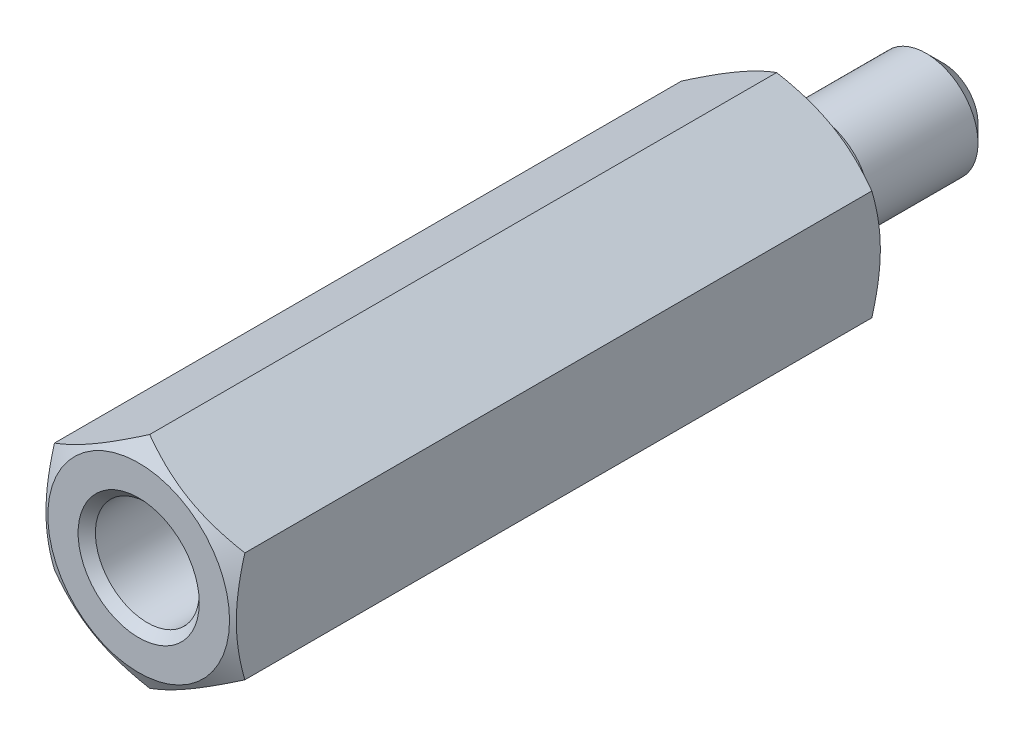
ISO-10303-21;
HEADER;
FILE_DESCRIPTION(('STEP AP214'),'2;1');
FILE_NAME('part.step','',(''),(''),'','','');
FILE_SCHEMA(('AUTOMOTIVE_DESIGN { 1 0 10303 214 1 1 1 1 }'));
ENDSEC;
DATA;
#1=APPLICATION_CONTEXT('core data for automotive mechanical design processes');
#2=APPLICATION_PROTOCOL_DEFINITION('international standard','automotive_design',2000,#1);
#3=PRODUCT_CONTEXT('',#1,'mechanical');
#4=PRODUCT('Part','Part','',(#3));
#5=PRODUCT_RELATED_PRODUCT_CATEGORY('part','',(#4));
#6=PRODUCT_DEFINITION_FORMATION('','',#4);
#7=PRODUCT_DEFINITION_CONTEXT('part definition',#1,'design');
#8=PRODUCT_DEFINITION('design','',#6,#7);
#9=PRODUCT_DEFINITION_SHAPE('','',#8);
#10=(LENGTH_UNIT() NAMED_UNIT(*) SI_UNIT(.MILLI.,.METRE.));
#11=(NAMED_UNIT(*) PLANE_ANGLE_UNIT() SI_UNIT($,.RADIAN.));
#12=(NAMED_UNIT(*) SI_UNIT($,.STERADIAN.) SOLID_ANGLE_UNIT());
#13=UNCERTAINTY_MEASURE_WITH_UNIT(LENGTH_MEASURE(1.E-05),#10,'distance_accuracy_value','');
#14=(GEOMETRIC_REPRESENTATION_CONTEXT(3) GLOBAL_UNCERTAINTY_ASSIGNED_CONTEXT((#13)) GLOBAL_UNIT_ASSIGNED_CONTEXT((#10,
#11,#12)) REPRESENTATION_CONTEXT('',''));
#15=CARTESIAN_POINT('',(0.,0.,0.));
#16=DIRECTION('',(0.,0.,1.));
#17=DIRECTION('',(1.,0.,0.));
#18=AXIS2_PLACEMENT_3D('',#15,#16,#17);
#19=CARTESIAN_POINT('',(0.,-12.7017059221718,0.));
#20=DIRECTION('',(0.,0.,-1.));
#21=DIRECTION('',(-1.,0.,0.));
#22=AXIS2_PLACEMENT_3D('',#19,#20,#21);
#23=PLANE('',#22);
#24=CARTESIAN_POINT('',(0.,0.,0.));
#25=DIRECTION('',(0.,0.,-1.));
#26=DIRECTION('',(-1.,0.,0.));
#27=AXIS2_PLACEMENT_3D('',#24,#25,#26);
#28=CIRCLE('',#27,5.1);
#29=CARTESIAN_POINT('',(-5.1,0.,0.));
#30=VERTEX_POINT('',#29);
#31=EDGE_CURVE('E23',#30,#30,#28,.F.);
#32=ORIENTED_EDGE('',*,*,#31,.T.);
#33=EDGE_LOOP('',(#32));
#34=FACE_BOUND('',#33,.T.);
#35=CARTESIAN_POINT('',(0.,0.,0.));
#36=DIRECTION('',(0.,0.,-1.));
#37=DIRECTION('',(-1.,0.,0.));
#38=AXIS2_PLACEMENT_3D('',#35,#36,#37);
#39=CIRCLE('',#38,10.5);
#40=CARTESIAN_POINT('',(-10.5,0.,0.));
#41=VERTEX_POINT('',#40);
#42=EDGE_CURVE('E73',#41,#41,#39,.T.);
#43=ORIENTED_EDGE('',*,*,#42,.T.);
#44=EDGE_LOOP('',(#43));
#45=FACE_BOUND('',#44,.T.);
#46=ADVANCED_FACE('F14',(#34,#45),#23,.T.);
#47=CARTESIAN_POINT('',(0.,0.,-18.));
#48=DIRECTION('',(0.,0.,1.));
#49=DIRECTION('',(1.,0.,0.));
#50=AXIS2_PLACEMENT_3D('',#47,#48,#49);
#51=CYLINDRICAL_SURFACE('',#50,6.);
#52=CARTESIAN_POINT('',(0.,0.,-3.5));
#53=DIRECTION('',(0.,0.,-1.));
#54=DIRECTION('',(-1.,0.,0.));
#55=AXIS2_PLACEMENT_3D('',#52,#53,#54);
#56=CIRCLE('',#55,6.);
#57=CARTESIAN_POINT('',(-6.,0.,-3.5));
#58=VERTEX_POINT('',#57);
#59=EDGE_CURVE('E233',#58,#58,#56,.T.);
#60=ORIENTED_EDGE('',*,*,#59,.T.);
#61=EDGE_LOOP('',(#60));
#62=FACE_BOUND('',#61,.T.);
#63=CARTESIAN_POINT('',(0.,0.,-16.));
#64=DIRECTION('',(0.,0.,-1.));
#65=DIRECTION('',(-1.,0.,0.));
#66=AXIS2_PLACEMENT_3D('',#63,#64,#65);
#67=CIRCLE('',#66,6.);
#68=CARTESIAN_POINT('',(-6.,0.,-16.));
#69=VERTEX_POINT('',#68);
#70=EDGE_CURVE('E85',#69,#69,#67,.F.);
#71=ORIENTED_EDGE('',*,*,#70,.T.);
#72=EDGE_LOOP('',(#71));
#73=FACE_BOUND('',#72,.T.);
#74=ADVANCED_FACE('F209',(#62,#73),#51,.T.);
#75=CARTESIAN_POINT('',(0.,0.,-18.));
#76=DIRECTION('',(0.,0.,-1.));
#77=DIRECTION('',(-1.,0.,0.));
#78=AXIS2_PLACEMENT_3D('',#75,#76,#77);
#79=PLANE('',#78);
#80=CARTESIAN_POINT('',(0.,0.,-18.));
#81=DIRECTION('',(0.,0.,-1.));
#82=DIRECTION('',(-1.,0.,0.));
#83=AXIS2_PLACEMENT_3D('',#80,#81,#82);
#84=CIRCLE('',#83,4.);
#85=CARTESIAN_POINT('',(-4.,0.,-18.));
#86=VERTEX_POINT('',#85);
#87=EDGE_CURVE('E82',#86,#86,#84,.T.);
#88=ORIENTED_EDGE('',*,*,#87,.T.);
#89=EDGE_LOOP('',(#88));
#90=FACE_BOUND('',#89,.T.);
#91=ADVANCED_FACE('F213',(#90),#79,.T.);
#92=CARTESIAN_POINT('',(0.,0.,-18.));
#93=DIRECTION('',(0.,0.,1.));
#94=DIRECTION('',(1.,0.,0.));
#95=AXIS2_PLACEMENT_3D('',#92,#93,#94);
#96=CONICAL_SURFACE('',#95,4.,0.785398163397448);
#97=ORIENTED_EDGE('',*,*,#70,.F.);
#98=EDGE_LOOP('',(#97));
#99=FACE_BOUND('',#98,.T.);
#100=ORIENTED_EDGE('',*,*,#87,.F.);
#101=EDGE_LOOP('',(#100));
#102=FACE_BOUND('',#101,.T.);
#103=ADVANCED_FACE('F216',(#99,#102),#96,.T.);
#104=CARTESIAN_POINT('',(0.,0.,-3.5));
#105=DIRECTION('',(0.,0.,-1.));
#106=DIRECTION('',(-1.,0.,0.));
#107=AXIS2_PLACEMENT_3D('',#104,#105,#106);
#108=PLANE('',#107);
#109=CARTESIAN_POINT('',(0.,0.,-3.5));
#110=DIRECTION('',(0.,0.,-1.));
#111=DIRECTION('',(-1.,0.,0.));
#112=AXIS2_PLACEMENT_3D('',#109,#110,#111);
#113=CIRCLE('',#112,5.1);
#114=CARTESIAN_POINT('',(-5.1,0.,-3.5));
#115=VERTEX_POINT('',#114);
#116=EDGE_CURVE('E93',#115,#115,#113,.T.);
#117=ORIENTED_EDGE('',*,*,#116,.T.);
#118=EDGE_LOOP('',(#117));
#119=FACE_BOUND('',#118,.T.);
#120=ORIENTED_EDGE('',*,*,#59,.F.);
#121=EDGE_LOOP('',(#120));
#122=FACE_BOUND('',#121,.T.);
#123=ADVANCED_FACE('F218',(#119,#122),#108,.F.);
#124=CARTESIAN_POINT('',(0.,0.,-3.5));
#125=DIRECTION('',(0.,0.,1.));
#126=DIRECTION('',(1.,0.,0.));
#127=AXIS2_PLACEMENT_3D('',#124,#125,#126);
#128=CYLINDRICAL_SURFACE('',#127,4.7);
#129=CARTESIAN_POINT('',(0.,0.,-3.1));
#130=DIRECTION('',(0.,0.,-1.));
#131=DIRECTION('',(-1.,0.,0.));
#132=AXIS2_PLACEMENT_3D('',#129,#130,#131);
#133=CIRCLE('',#132,4.7);
#134=CARTESIAN_POINT('',(-4.7,0.,-3.1));
#135=VERTEX_POINT('',#134);
#136=EDGE_CURVE('E99',#135,#135,#133,.F.);
#137=ORIENTED_EDGE('',*,*,#136,.T.);
#138=EDGE_LOOP('',(#137));
#139=FACE_BOUND('',#138,.T.);
#140=CARTESIAN_POINT('',(0.,0.,-0.4));
#141=DIRECTION('',(0.,0.,-1.));
#142=DIRECTION('',(-1.,0.,0.));
#143=AXIS2_PLACEMENT_3D('',#140,#141,#142);
#144=CIRCLE('',#143,4.7);
#145=CARTESIAN_POINT('',(-4.7,0.,-0.4));
#146=VERTEX_POINT('',#145);
#147=EDGE_CURVE('E96',#146,#146,#144,.T.);
#148=ORIENTED_EDGE('',*,*,#147,.T.);
#149=EDGE_LOOP('',(#148));
#150=FACE_BOUND('',#149,.T.);
#151=ADVANCED_FACE('F121',(#139,#150),#128,.T.);
#152=CARTESIAN_POINT('',(0.,0.,-3.1));
#153=DIRECTION('',(0.,0.,-1.));
#154=DIRECTION('',(-1.,0.,0.));
#155=AXIS2_PLACEMENT_3D('',#152,#153,#154);
#156=TOROIDAL_SURFACE('',#155,5.1,0.4);
#157=ORIENTED_EDGE('',*,*,#136,.F.);
#158=EDGE_LOOP('',(#157));
#159=FACE_BOUND('',#158,.T.);
#160=ORIENTED_EDGE('',*,*,#116,.F.);
#161=EDGE_LOOP('',(#160));
#162=FACE_BOUND('',#161,.T.);
#163=ADVANCED_FACE('F226',(#159,#162),#156,.F.);
#164=CARTESIAN_POINT('',(0.,0.,-0.4));
#165=DIRECTION('',(0.,0.,-1.));
#166=DIRECTION('',(-1.,0.,0.));
#167=AXIS2_PLACEMENT_3D('',#164,#165,#166);
#168=TOROIDAL_SURFACE('',#167,5.1,0.4);
#169=ORIENTED_EDGE('',*,*,#31,.F.);
#170=EDGE_LOOP('',(#169));
#171=FACE_BOUND('',#170,.T.);
#172=ORIENTED_EDGE('',*,*,#147,.F.);
#173=EDGE_LOOP('',(#172));
#174=FACE_BOUND('',#173,.T.);
#175=ADVANCED_FACE('F16',(#171,#174),#168,.F.);
#176=CARTESIAN_POINT('',(0.,0.,0.));
#177=DIRECTION('',(0.,0.,1.));
#178=DIRECTION('',(-1.,0.,0.));
#179=AXIS2_PLACEMENT_3D('',#176,#177,#178);
#180=CONICAL_SURFACE('',#179,10.5,1.0471975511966);
#181=ORIENTED_EDGE('',*,*,#42,.F.);
#182=EDGE_LOOP('',(#181));
#183=FACE_BOUND('',#182,.T.);
#184=CARTESIAN_POINT('',(11.,-62.4972873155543,30.5752844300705));
#185=CARTESIAN_POINT('',(11.,-61.5220211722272,30.0207413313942));
#186=CARTESIAN_POINT('',(11.,-60.5465901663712,29.4664881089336));
#187=CARTESIAN_POINT('',(11.,-58.5953397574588,28.3586605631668));
#188=CARTESIAN_POINT('',(11.,-57.6195203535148,27.8050862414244));
#189=CARTESIAN_POINT('',(11.,-54.6891666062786,26.144269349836));
#190=CARTESIAN_POINT('',(11.,-52.7339663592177,25.0382012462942));
#191=CARTESIAN_POINT('',(11.,-48.7763128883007,22.8050361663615));
#192=CARTESIAN_POINT('',(11.,-46.7738037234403,21.6780382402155));
#193=CARTESIAN_POINT('',(11.,-43.7684695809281,19.993035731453));
#194=CARTESIAN_POINT('',(11.,-42.7670054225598,19.4326042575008));
#195=CARTESIAN_POINT('',(11.,-40.7629681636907,18.3137278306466));
#196=CARTESIAN_POINT('',(11.,-39.7603950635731,17.7552828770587));
#197=CARTESIAN_POINT('',(11.,-37.3765857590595,16.431277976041));
#198=CARTESIAN_POINT('',(11.,-35.9947422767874,15.666810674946));
#199=CARTESIAN_POINT('',(11.,-33.2274259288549,14.1441353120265));
#200=CARTESIAN_POINT('',(11.,-31.8419527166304,13.3859278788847));
#201=CARTESIAN_POINT('',(11.,-29.7572506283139,12.2539216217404));
#202=CARTESIAN_POINT('',(11.,-29.0598684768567,11.8767223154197));
#203=CARTESIAN_POINT('',(11.,-27.663594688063,11.1251291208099));
#204=CARTESIAN_POINT('',(11.,-26.9647030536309,10.7507352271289));
#205=CARTESIAN_POINT('',(11.,-25.5653388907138,10.0055280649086));
#206=CARTESIAN_POINT('',(11.,-24.8648670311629,9.63471354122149));
#207=CARTESIAN_POINT('',(11.,-23.4616668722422,8.89738134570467));
#208=CARTESIAN_POINT('',(11.,-22.7589385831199,8.53086365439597));
#209=CARTESIAN_POINT('',(11.,-21.3630408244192,7.80966571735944));
#210=CARTESIAN_POINT('',(11.,-20.6699204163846,7.45489063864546));
#211=CARTESIAN_POINT('',(11.,-19.2802461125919,6.75207729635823));
#212=CARTESIAN_POINT('',(11.,-18.5836921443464,6.40403917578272));
#213=CARTESIAN_POINT('',(11.,-17.1851662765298,5.71626941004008));
#214=CARTESIAN_POINT('',(11.,-16.4831877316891,5.37655124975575));
#215=CARTESIAN_POINT('',(11.,-15.0736394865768,4.70895084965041));
#216=CARTESIAN_POINT('',(11.,-14.3660701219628,4.3810679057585));
#217=CARTESIAN_POINT('',(11.,-13.3018966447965,3.90262328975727));
#218=CARTESIAN_POINT('',(11.,-12.9480447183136,3.74593892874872));
#219=CARTESIAN_POINT('',(11.,-12.2382815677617,3.43731213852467));
#220=CARTESIAN_POINT('',(11.,-11.8823703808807,3.28536962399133));
#221=CARTESIAN_POINT('',(11.,-11.1680769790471,2.98704186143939));
#222=CARTESIAN_POINT('',(11.,-10.8096939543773,2.84065854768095));
#223=CARTESIAN_POINT('',(11.,-10.0902654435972,2.55457771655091));
#224=CARTESIAN_POINT('',(11.,-9.72921998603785,2.414880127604));
#225=CARTESIAN_POINT('',(11.,-9.00510111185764,2.14383734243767));
#226=CARTESIAN_POINT('',(11.,-8.64203573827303,2.01247073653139));
#227=CARTESIAN_POINT('',(11.,-7.91256739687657,1.75924110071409));
#228=CARTESIAN_POINT('',(11.,-7.54616425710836,1.63737856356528));
#229=CARTESIAN_POINT('',(11.,-6.8100203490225,1.4051159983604));
#230=CARTESIAN_POINT('',(11.,-6.44028220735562,1.29470768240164));
#231=CARTESIAN_POINT('',(11.,-5.69703860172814,1.08742436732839));
#232=CARTESIAN_POINT('',(11.,-5.32353366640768,0.99054749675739));
#233=CARTESIAN_POINT('',(11.,-4.81365817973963,0.869783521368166));
#234=CARTESIAN_POINT('',(11.,-4.67891551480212,0.838949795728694));
#235=CARTESIAN_POINT('',(11.,-4.40893661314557,0.779438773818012));
#236=CARTESIAN_POINT('',(11.,-4.27370032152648,0.750761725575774));
#237=CARTESIAN_POINT('',(11.,-4.00272188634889,0.695674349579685));
#238=CARTESIAN_POINT('',(11.,-3.86697959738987,0.669264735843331));
#239=CARTESIAN_POINT('',(11.,-3.59505679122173,0.618836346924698));
#240=CARTESIAN_POINT('',(11.,-3.45887628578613,0.594817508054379));
#241=CARTESIAN_POINT('',(11.,-3.04983456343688,0.526534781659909));
#242=CARTESIAN_POINT('',(11.,-2.7763351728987,0.486016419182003));
#243=CARTESIAN_POINT('',(11.,-2.22796217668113,0.415793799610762));
#244=CARTESIAN_POINT('',(11.,-1.95308863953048,0.386089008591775));
#245=CARTESIAN_POINT('',(11.,-1.40830320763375,0.338665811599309));
#246=CARTESIAN_POINT('',(11.,-1.13841286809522,0.320701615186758));
#247=CARTESIAN_POINT('',(11.,-0.598117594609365,0.296155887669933));
#248=CARTESIAN_POINT('',(11.,-0.327712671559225,0.289574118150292));
#249=CARTESIAN_POINT('',(11.,0.213284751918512,0.287947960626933));
#250=CARTESIAN_POINT('',(11.,0.483877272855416,0.292910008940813));
#251=CARTESIAN_POINT('',(11.,1.02461499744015,0.314264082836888));
#252=CARTESIAN_POINT('',(11.,1.29476017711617,0.330656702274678));
#253=CARTESIAN_POINT('',(11.,1.94326774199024,0.383383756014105));
#254=CARTESIAN_POINT('',(11.,2.32120175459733,0.425102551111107));
#255=CARTESIAN_POINT('',(11.,3.07428279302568,0.528656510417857));
#256=CARTESIAN_POINT('',(11.,3.44942945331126,0.590494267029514));
#257=CARTESIAN_POINT('',(11.,4.56996783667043,0.802868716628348));
#258=CARTESIAN_POINT('',(11.,5.31033874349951,0.980255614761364));
#259=CARTESIAN_POINT('',(11.,6.41956093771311,1.28859766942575));
#260=CARTESIAN_POINT('',(11.,6.7941112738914,1.40022533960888));
#261=CARTESIAN_POINT('',(11.,7.53956311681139,1.63517078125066));
#262=CARTESIAN_POINT('',(11.,7.91046459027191,1.75848865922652));
#263=CARTESIAN_POINT('',(11.,8.64881114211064,2.01484538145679));
#264=CARTESIAN_POINT('',(11.,9.0162566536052,2.14788298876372));
#265=CARTESIAN_POINT('',(11.,9.56512421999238,2.35352706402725));
#266=CARTESIAN_POINT('',(11.,9.74769400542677,2.42308865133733));
#267=CARTESIAN_POINT('',(11.,10.1121133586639,2.56407178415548));
#268=CARTESIAN_POINT('',(11.,10.293962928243,2.63549332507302));
#269=CARTESIAN_POINT('',(11.,10.9060798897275,2.87920923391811));
#270=CARTESIAN_POINT('',(11.,11.334787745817,3.05542872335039));
#271=CARTESIAN_POINT('',(11.,12.1889467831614,3.41561009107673));
#272=CARTESIAN_POINT('',(11.,12.614397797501,3.5995723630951));
#273=CARTESIAN_POINT('',(11.,13.4625801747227,3.97386187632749));
#274=CARTESIAN_POINT('',(11.,13.8853110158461,4.16419029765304));
#275=CARTESIAN_POINT('',(11.,14.7283717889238,4.55006279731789));
#276=CARTESIAN_POINT('',(11.,15.148701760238,4.74560678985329));
#277=CARTESIAN_POINT('',(11.,15.9876003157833,5.14116585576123));
#278=CARTESIAN_POINT('',(11.,16.406167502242,5.34118388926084));
#279=CARTESIAN_POINT('',(11.,17.2415428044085,5.74486336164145));
#280=CARTESIAN_POINT('',(11.,17.6583509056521,5.94852483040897));
#281=CARTESIAN_POINT('',(11.,18.9064264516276,6.5640527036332));
#282=CARTESIAN_POINT('',(11.,19.7354327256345,6.98050418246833));
#283=CARTESIAN_POINT('',(11.,21.3907859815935,7.82322876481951));
#284=CARTESIAN_POINT('',(11.,22.2171226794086,8.24952198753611));
#285=CARTESIAN_POINT('',(11.,23.8663274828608,9.10879737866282));
#286=CARTESIAN_POINT('',(11.,24.6891955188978,9.54177968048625));
#287=CARTESIAN_POINT('',(11.,26.3318965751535,10.4126834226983));
#288=CARTESIAN_POINT('',(11.,27.1517306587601,10.8506028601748));
#289=CARTESIAN_POINT('',(11.,28.7892450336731,11.7304337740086));
#290=CARTESIAN_POINT('',(11.,29.6069253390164,12.1723452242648));
#291=CARTESIAN_POINT('',(11.,31.8102095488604,13.3686062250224));
#292=CARTESIAN_POINT('',(11.,33.1942010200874,14.1259244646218));
#293=CARTESIAN_POINT('',(11.,35.9588469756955,15.6469912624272));
#294=CARTESIAN_POINT('',(11.,37.3395010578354,16.4107405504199));
#295=CARTESIAN_POINT('',(11.,40.0925452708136,17.9397062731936));
#296=CARTESIAN_POINT('',(11.,41.4649459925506,18.7049036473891));
#297=CARTESIAN_POINT('',(11.,43.5220151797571,19.8552355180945));
#298=CARTESIAN_POINT('',(11.,44.2074068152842,20.2390780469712));
#299=CARTESIAN_POINT('',(11.,45.5777637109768,21.0075223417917));
#300=CARTESIAN_POINT('',(11.,46.2627289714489,21.3921241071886));
#301=CARTESIAN_POINT('',(11.,46.9475093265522,21.7770548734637));
#302=B_SPLINE_CURVE_WITH_KNOTS('',3,(#184,#185,#186,#187,#188,#189,#190,#191,#192,#193,#194,
#195,#196,#197,#198,#199,#200,#201,#202,#203,#204,#205,#206,#207,#208,#209,#210,#211,#212,#213,
#214,#215,#216,#217,#218,#219,#220,#221,#222,#223,#224,#225,#226,#227,#228,#229,#230,#231,#232,
#233,#234,#235,#236,#237,#238,#239,#240,#241,#242,#243,#244,#245,#246,#247,#248,#249,#250,#251,
#252,#253,#254,#255,#256,#257,#258,#259,#260,#261,#262,#263,#264,#265,#266,#267,#268,#269,#270,
#271,#272,#273,#274,#275,#276,#277,#278,#279,#280,#281,#282,#283,#284,#285,#286,#287,#288,#289,
#290,#291,#292,#293,#294,#295,#296,#297,#298,#299,#300,#301),.UNSPECIFIED.,.F.,.F.,(4,2,2,2,2,2,
2,2,2,2,2,2,2,2,2,2,2,2,2,2,2,2,2,2,2,2,2,2,2,2,2,2,2,2,2,2,2,2,2,2,2,2,2,2,2,2,2,2,2,2,2,2,2,2,
2,2,2,2,4),(0.,3.36570329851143,6.73141433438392,13.4705318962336,20.3641066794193,
23.8069416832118,27.2497754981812,31.9873925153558,36.7254796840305,39.1040438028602,
41.4826033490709,43.8602960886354,46.2379780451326,48.5738724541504,50.9098163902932,
53.2493246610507,55.5886935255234,56.7496359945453,57.9105575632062,59.0718794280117,
60.2331888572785,61.391381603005,62.5496343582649,63.7070431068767,64.8642916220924,
65.2789549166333,65.6936658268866,66.1085068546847,66.5233368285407,67.3525745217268,
68.18177126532,68.9929997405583,69.8042112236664,70.6158751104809,71.4275811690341,
72.5676297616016,73.7078253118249,75.9885739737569,77.1609650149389,78.3333667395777,
79.5056195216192,80.0917289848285,80.6778370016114,82.0682677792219,83.4587693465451,
84.8495301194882,86.2402680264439,87.631955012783,89.0236534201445,91.8067593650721,
94.5961724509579,97.3856412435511,100.174016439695,102.962373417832,107.695281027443,
112.428733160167,117.142651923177,119.49931681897,121.85598001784),.UNSPECIFIED.);
#303=CARTESIAN_POINT('',(11.,6.35085296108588,1.2711555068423));
#304=VERTEX_POINT('',#303);
#305=CARTESIAN_POINT('',(11.,-6.35085296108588,1.2711555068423));
#306=VERTEX_POINT('',#305);
#307=EDGE_CURVE('E30',#304,#306,#302,.F.);
#308=ORIENTED_EDGE('',*,*,#307,.T.);
#309=CARTESIAN_POINT('',(11.0002,-6.35073749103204,1.271222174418));
#310=CARTESIAN_POINT('',(10.7583962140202,-6.49034297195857,1.19063428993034));
#311=CARTESIAN_POINT('',(10.515690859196,-6.63046897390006,1.11370405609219));
#312=CARTESIAN_POINT('',(10.0283338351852,-6.91184468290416,0.968173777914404));
#313=CARTESIAN_POINT('',(9.78368155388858,-7.05309474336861,0.899576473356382));
#314=CARTESIAN_POINT('',(9.0457826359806,-7.47912088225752,0.707611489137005));
#315=CARTESIAN_POINT('',(8.54962304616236,-7.7655787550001,0.598422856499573));
#316=CARTESIAN_POINT('',(7.80714296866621,-8.19424982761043,0.470389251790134));
#317=CARTESIAN_POINT('',(7.56304065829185,-8.33518236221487,0.433917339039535));
#318=CARTESIAN_POINT('',(7.07370581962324,-8.61769996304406,0.372756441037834));
#319=CARTESIAN_POINT('',(6.82847326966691,-8.7592850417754,0.348067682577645));
#320=CARTESIAN_POINT('',(6.33759931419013,-9.0426912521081,0.311105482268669));
#321=CARTESIAN_POINT('',(6.0919587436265,-9.18451190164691,0.298817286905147));
#322=CARTESIAN_POINT('',(5.60044998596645,-9.468284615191,0.286918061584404));
#323=CARTESIAN_POINT('',(5.35458180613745,-9.61023667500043,0.287306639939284));
#324=CARTESIAN_POINT('',(4.89492981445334,-9.87561687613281,0.299876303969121));
#325=CARTESIAN_POINT('',(4.68111322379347,-9.99906394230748,0.310524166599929));
#326=CARTESIAN_POINT('',(4.25397181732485,-10.2456741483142,0.34120676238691));
#327=CARTESIAN_POINT('',(4.04064703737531,-10.3688372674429,0.36124215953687));
#328=CARTESIAN_POINT('',(3.6146051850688,-10.6148126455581,0.410350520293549));
#329=CARTESIAN_POINT('',(3.4018887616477,-10.7376245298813,0.439430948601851));
#330=CARTESIAN_POINT('',(2.97745318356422,-10.9826725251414,0.50611913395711));
#331=CARTESIAN_POINT('',(2.76573409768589,-11.1049085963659,0.543727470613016));
#332=CARTESIAN_POINT('',(2.12304886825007,-11.4759630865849,0.670295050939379));
#333=CARTESIAN_POINT('',(1.69394387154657,-11.7237069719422,0.771874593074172));
#334=CARTESIAN_POINT('',(0.842132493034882,-12.2155005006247,1.00241883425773));
#335=CARTESIAN_POINT('',(0.419415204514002,-12.4595564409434,1.13132938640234));
#336=CARTESIAN_POINT('',(-0.000199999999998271,-12.7018213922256,1.271222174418));
#337=B_SPLINE_CURVE_WITH_KNOTS('',3,(#309,#310,#311,#312,#313,#314,#315,#316,#317,#318,#319,
#320,#321,#322,#323,#324,#325,#326,#327,#328,#329,#330,#331,#332,#333,#334,#335,#336),
.UNSPECIFIED.,.F.,.F.,(4,2,2,2,2,2,2,2,2,2,2,2,2,4),(0.,0.871755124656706,1.74379610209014,
3.49159027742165,4.34403665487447,5.19649943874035,6.0479468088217,6.89936787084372,
7.64056020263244,8.38180496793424,9.1236630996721,9.86557166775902,11.3820155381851,
12.8954827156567),.UNSPECIFIED.);
#338=CARTESIAN_POINT('',(0.,-12.7017059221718,1.2711555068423));
#339=VERTEX_POINT('',#338);
#340=EDGE_CURVE('E67',#306,#339,#337,.T.);
#341=ORIENTED_EDGE('',*,*,#340,.T.);
#342=CARTESIAN_POINT('',(0.000200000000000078,-12.7018213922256,1.271222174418));
#343=CARTESIAN_POINT('',(-0.241603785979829,-12.5622159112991,1.19063428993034));
#344=CARTESIAN_POINT('',(-0.484309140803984,-12.4220899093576,1.11370405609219));
#345=CARTESIAN_POINT('',(-0.971666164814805,-12.1407142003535,0.968173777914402));
#346=CARTESIAN_POINT('',(-1.21631844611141,-11.999464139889,0.89957647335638));
#347=CARTESIAN_POINT('',(-1.9542173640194,-11.5734380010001,0.707611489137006));
#348=CARTESIAN_POINT('',(-2.45037695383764,-11.2869801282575,0.598422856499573));
#349=CARTESIAN_POINT('',(-3.19285703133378,-10.8583090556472,0.470389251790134));
#350=CARTESIAN_POINT('',(-3.43695934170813,-10.7173765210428,0.433917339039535));
#351=CARTESIAN_POINT('',(-3.92629418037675,-10.4348589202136,0.372756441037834));
#352=CARTESIAN_POINT('',(-4.17152673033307,-10.2932738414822,0.348067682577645));
#353=CARTESIAN_POINT('',(-4.66240068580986,-10.0098676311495,0.311105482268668));
#354=CARTESIAN_POINT('',(-4.90804125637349,-9.86804698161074,0.298817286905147));
#355=CARTESIAN_POINT('',(-5.39955001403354,-9.58427426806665,0.286918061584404));
#356=CARTESIAN_POINT('',(-5.64541819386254,-9.44232220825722,0.287306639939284));
#357=CARTESIAN_POINT('',(-6.10507018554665,-9.17694200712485,0.299876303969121));
#358=CARTESIAN_POINT('',(-6.31888677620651,-9.05349494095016,0.310524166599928));
#359=CARTESIAN_POINT('',(-6.74602818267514,-8.80688473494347,0.341206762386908));
#360=CARTESIAN_POINT('',(-6.95935296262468,-8.68372161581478,0.361242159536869));
#361=CARTESIAN_POINT('',(-7.38539481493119,-8.43774623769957,0.410350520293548));
#362=CARTESIAN_POINT('',(-7.59811123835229,-8.31493435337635,0.439430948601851));
#363=CARTESIAN_POINT('',(-8.02254681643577,-8.0698863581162,0.506119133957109));
#364=CARTESIAN_POINT('',(-8.2342659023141,-7.94765028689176,0.543727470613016));
#365=CARTESIAN_POINT('',(-8.87695113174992,-7.57659579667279,0.670295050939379));
#366=CARTESIAN_POINT('',(-9.30605612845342,-7.32885191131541,0.771874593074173));
#367=CARTESIAN_POINT('',(-10.1578675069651,-6.8370583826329,1.00241883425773));
#368=CARTESIAN_POINT('',(-10.580584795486,-6.59300244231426,1.13132938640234));
#369=CARTESIAN_POINT('',(-11.0002,-6.35073749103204,1.271222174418));
#370=B_SPLINE_CURVE_WITH_KNOTS('',3,(#342,#343,#344,#345,#346,#347,#348,#349,#350,#351,#352,
#353,#354,#355,#356,#357,#358,#359,#360,#361,#362,#363,#364,#365,#366,#367,#368,#369),
.UNSPECIFIED.,.F.,.F.,(4,2,2,2,2,2,2,2,2,2,2,2,2,4),(0.,0.871755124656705,1.74379610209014,
3.49159027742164,4.34403665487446,5.19649943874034,6.04794680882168,6.89936787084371,
7.64056020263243,8.38180496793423,9.12366309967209,9.86557166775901,11.3820155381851,
12.8954827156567),.UNSPECIFIED.);
#371=CARTESIAN_POINT('',(-11.,-6.35085296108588,1.2711555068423));
#372=VERTEX_POINT('',#371);
#373=EDGE_CURVE('E69',#339,#372,#370,.T.);
#374=ORIENTED_EDGE('',*,*,#373,.T.);
#375=CARTESIAN_POINT('',(-11.,-62.4972873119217,30.5752844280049));
#376=CARTESIAN_POINT('',(-11.,-61.5220211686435,30.0207413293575));
#377=CARTESIAN_POINT('',(-11.,-60.5465901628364,29.4664881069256));
#378=CARTESIAN_POINT('',(-11.,-58.5953397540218,28.3586605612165));
#379=CARTESIAN_POINT('',(-11.,-57.6195203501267,27.8050862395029));
#380=CARTESIAN_POINT('',(-11.,-54.6891666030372,26.1442693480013));
#381=CARTESIAN_POINT('',(-11.,-52.7339663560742,25.0382012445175));
#382=CARTESIAN_POINT('',(-11.,-48.7763128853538,22.8050361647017));
#383=CARTESIAN_POINT('',(-11.,-46.7738037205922,21.6780382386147));
#384=CARTESIAN_POINT('',(-11.,-43.768469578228,19.9930357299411));
#385=CARTESIAN_POINT('',(-11.,-42.7670054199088,19.4326042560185));
#386=CARTESIAN_POINT('',(-11.,-40.7629681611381,18.3137278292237));
#387=CARTESIAN_POINT('',(-11.,-39.7603950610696,17.7552828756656));
#388=CARTESIAN_POINT('',(-11.,-37.3765857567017,16.431277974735));
#389=CARTESIAN_POINT('',(-11.,-35.9947422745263,15.6668106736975));
#390=CARTESIAN_POINT('',(-11.,-33.2274259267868,14.1441353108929));
#391=CARTESIAN_POINT('',(-11.,-31.8419527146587,13.3859278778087));
#392=CARTESIAN_POINT('',(-11.,-29.7572506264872,12.2539216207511));
#393=CARTESIAN_POINT('',(-11.,-29.0598684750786,11.8767223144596));
#394=CARTESIAN_POINT('',(-11.,-27.6635946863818,11.125129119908));
#395=CARTESIAN_POINT('',(-11.,-26.9647030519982,10.7507352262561));
#396=CARTESIAN_POINT('',(-11.,-25.565338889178,10.0055280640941));
#397=CARTESIAN_POINT('',(-11.,-24.8648670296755,9.63471354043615));
#398=CARTESIAN_POINT('',(-11.,-23.4616668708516,8.89738134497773));
#399=CARTESIAN_POINT('',(-11.,-22.7589385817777,8.53086365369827));
#400=CARTESIAN_POINT('',(-11.,-21.3630408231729,7.80966571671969));
#401=CARTESIAN_POINT('',(-11.,-20.6699204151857,7.45489063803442));
#402=CARTESIAN_POINT('',(-11.,-19.280246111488,6.75207729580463));
#403=CARTESIAN_POINT('',(-11.,-18.58369214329,6.40403917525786));
#404=CARTESIAN_POINT('',(-11.,-17.1851662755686,5.71626940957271));
#405=CARTESIAN_POINT('',(-11.,-16.4831877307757,5.37655124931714));
#406=CARTESIAN_POINT('',(-11.,-15.0736394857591,4.70895084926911));
#407=CARTESIAN_POINT('',(-11.,-14.366070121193,4.38106790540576));
#408=CARTESIAN_POINT('',(-11.,-13.3018966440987,3.90262328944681));
#409=CARTESIAN_POINT('',(-11.,-12.9480447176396,3.74593892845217));
#410=CARTESIAN_POINT('',(-11.,-12.2382815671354,3.43731213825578));
#411=CARTESIAN_POINT('',(-11.,-11.8823703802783,3.28536962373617));
#412=CARTESIAN_POINT('',(-11.,-11.1680769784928,2.98704186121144));
#413=CARTESIAN_POINT('',(-11.,-10.8096939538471,2.84065854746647));
#414=CARTESIAN_POINT('',(-11.,-10.0902654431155,2.55457771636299));
#415=CARTESIAN_POINT('',(-11.,-9.72921998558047,2.41488012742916));
#416=CARTESIAN_POINT('',(-11.,-9.00510111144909,2.14383734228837));
#417=CARTESIAN_POINT('',(-11.,-8.64203573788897,2.01247073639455));
#418=CARTESIAN_POINT('',(-11.,-7.91256739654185,1.7592411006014));
#419=CARTESIAN_POINT('',(-11.,-7.5461642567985,1.63737856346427));
#420=CARTESIAN_POINT('',(-11.,-6.81002034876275,1.40511599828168));
#421=CARTESIAN_POINT('',(-11.,-6.44028220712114,1.29470768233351));
#422=CARTESIAN_POINT('',(-11.,-5.69703860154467,1.08742436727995));
#423=CARTESIAN_POINT('',(-11.,-5.32353366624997,0.990547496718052));
#424=CARTESIAN_POINT('',(-11.,-4.81365817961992,0.869783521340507));
#425=CARTESIAN_POINT('',(-11.,-4.6789155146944,0.838949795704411));
#426=CARTESIAN_POINT('',(-11.,-4.40893661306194,0.779438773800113));
#427=CARTESIAN_POINT('',(-11.,-4.27370032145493,0.750761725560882));
#428=CARTESIAN_POINT('',(-11.,-4.00272188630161,0.695674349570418));
#429=CARTESIAN_POINT('',(-11.,-3.86697959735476,0.66926473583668));
#430=CARTESIAN_POINT('',(-11.,-3.59505679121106,0.618836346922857));
#431=CARTESIAN_POINT('',(-11.,-3.45887628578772,0.59481750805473));
#432=CARTESIAN_POINT('',(-11.,-3.04983456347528,0.52653478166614));
#433=CARTESIAN_POINT('',(-11.,-2.77633517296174,0.486016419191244));
#434=CARTESIAN_POINT('',(-11.,-2.22796217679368,0.415793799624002));
#435=CARTESIAN_POINT('',(-11.,-1.9530886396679,0.386089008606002));
#436=CARTESIAN_POINT('',(-11.,-1.40830320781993,0.338665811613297));
#437=CARTESIAN_POINT('',(-11.,-1.1384128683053,0.320701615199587));
#438=CARTESIAN_POINT('',(-11.,-0.598117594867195,0.296155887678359));
#439=CARTESIAN_POINT('',(-11.,-0.327712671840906,0.289574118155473));
#440=CARTESIAN_POINT('',(-11.,0.213284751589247,0.287947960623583));
#441=CARTESIAN_POINT('',(-11.,0.483877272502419,0.292910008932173));
#442=CARTESIAN_POINT('',(-11.,1.02461499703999,0.314264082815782));
#443=CARTESIAN_POINT('',(-11.,1.29476017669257,0.330656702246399));
#444=CARTESIAN_POINT('',(-11.,1.9432677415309,0.383383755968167));
#445=CARTESIAN_POINT('',(-11.,2.32120175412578,0.42510255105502));
#446=CARTESIAN_POINT('',(-11.,3.07428279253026,0.528656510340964));
#447=CARTESIAN_POINT('',(-11.,3.44942945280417,0.590494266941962));
#448=CARTESIAN_POINT('',(-11.,4.56996783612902,0.802868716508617));
#449=CARTESIAN_POINT('',(-11.,5.31033874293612,0.980255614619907));
#450=CARTESIAN_POINT('',(-11.,6.41956093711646,1.2885976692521));
#451=CARTESIAN_POINT('',(-11.,6.79411127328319,1.40022533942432));
#452=CARTESIAN_POINT('',(-11.,7.53956311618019,1.6351707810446));
#453=CARTESIAN_POINT('',(-11.,7.91046458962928,1.75848865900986));
#454=CARTESIAN_POINT('',(-11.,8.64881114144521,2.01484538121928));
#455=CARTESIAN_POINT('',(-11.,9.01625665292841,2.14788298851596));
#456=CARTESIAN_POINT('',(-11.,9.56512421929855,2.35352706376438));
#457=CARTESIAN_POINT('',(-11.,9.74769400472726,2.42308865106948));
#458=CARTESIAN_POINT('',(-11.,10.1121133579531,2.5640717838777));
#459=CARTESIAN_POINT('',(-11.,10.2939629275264,2.63549332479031));
#460=CARTESIAN_POINT('',(-11.,10.9060798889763,2.87920923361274));
#461=CARTESIAN_POINT('',(-11.,11.3347877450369,3.05542872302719));
#462=CARTESIAN_POINT('',(-11.,12.1889467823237,3.41561009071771));
#463=CARTESIAN_POINT('',(-11.,12.6143977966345,3.59957236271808));
#464=CARTESIAN_POINT('',(-11.,13.4625801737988,3.97386187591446));
#465=CARTESIAN_POINT('',(-11.,13.8853110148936,4.16419029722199));
#466=CARTESIAN_POINT('',(-11.,14.728371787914,4.55006279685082));
#467=CARTESIAN_POINT('',(-11.,15.1487017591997,4.74560678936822));
#468=CARTESIAN_POINT('',(-11.,15.9876003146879,5.1411658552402));
#469=CARTESIAN_POINT('',(-11.,16.4061675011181,5.34118388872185));
#470=CARTESIAN_POINT('',(-11.,17.2415428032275,5.74486336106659));
#471=CARTESIAN_POINT('',(-11.,17.6583509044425,5.9485248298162));
#472=CARTESIAN_POINT('',(-11.,18.9064264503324,6.5640527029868));
#473=CARTESIAN_POINT('',(-11.,19.7354327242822,6.98050418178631));
#474=CARTESIAN_POINT('',(-11.,21.390785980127,7.82322876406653));
#475=CARTESIAN_POINT('',(-11.,22.2171226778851,8.2495219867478));
#476=CARTESIAN_POINT('',(-11.,23.866327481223,9.10879737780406));
#477=CARTESIAN_POINT('',(-11.,24.6891955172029,9.54177967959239));
#478=CARTESIAN_POINT('',(-11.,26.3318965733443,10.4126834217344));
#479=CARTESIAN_POINT('',(-11.,27.1517306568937,10.8506028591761));
#480=CARTESIAN_POINT('',(-11.,28.7892450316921,11.7304337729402));
#481=CARTESIAN_POINT('',(-11.,29.6069253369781,12.1723452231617));
#482=CARTESIAN_POINT('',(-11.,31.8102095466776,13.3686062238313));
#483=CARTESIAN_POINT('',(-11.,33.1942010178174,14.1259244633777));
#484=CARTESIAN_POINT('',(-11.,35.9588469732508,15.6469912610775));
#485=CARTESIAN_POINT('',(-11.,37.3395010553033,16.4107405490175));
#486=CARTESIAN_POINT('',(-11.,40.0925452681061,17.939706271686));
#487=CARTESIAN_POINT('',(-11.,41.4649459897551,18.704903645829));
#488=CARTESIAN_POINT('',(-11.,43.5220151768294,19.8552355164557));
#489=CARTESIAN_POINT('',(-11.,44.2074068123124,20.2390780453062));
#490=CARTESIAN_POINT('',(-11.,45.5777637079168,21.0075223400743));
#491=CARTESIAN_POINT('',(-11.,46.2627289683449,21.3921241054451));
#492=CARTESIAN_POINT('',(-11.,46.9475093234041,21.777054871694));
#493=B_SPLINE_CURVE_WITH_KNOTS('',3,(#375,#376,#377,#378,#379,#380,#381,#382,#383,#384,#385,
#386,#387,#388,#389,#390,#391,#392,#393,#394,#395,#396,#397,#398,#399,#400,#401,#402,#403,#404,
#405,#406,#407,#408,#409,#410,#411,#412,#413,#414,#415,#416,#417,#418,#419,#420,#421,#422,#423,
#424,#425,#426,#427,#428,#429,#430,#431,#432,#433,#434,#435,#436,#437,#438,#439,#440,#441,#442,
#443,#444,#445,#446,#447,#448,#449,#450,#451,#452,#453,#454,#455,#456,#457,#458,#459,#460,#461,
#462,#463,#464,#465,#466,#467,#468,#469,#470,#471,#472,#473,#474,#475,#476,#477,#478,#479,#480,
#481,#482,#483,#484,#485,#486,#487,#488,#489,#490,#491,#492),.UNSPECIFIED.,.F.,.F.,(4,2,2,2,2,2,
2,2,2,2,2,2,2,2,2,2,2,2,2,2,2,2,2,2,2,2,2,2,2,2,2,2,2,2,2,2,2,2,2,2,2,2,2,2,2,2,2,2,2,2,2,2,2,2,
2,2,2,2,4),(0.,3.3657032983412,6.73141433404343,13.470531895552,20.3641066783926,
23.8069416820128,27.2497754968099,31.9873925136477,36.7254796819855,39.1040438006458,
41.482603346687,43.8602960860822,46.2379780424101,48.5738724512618,50.9098163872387,
53.2493246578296,55.5886935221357,56.7496359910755,57.9105575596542,59.0718794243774,
60.233188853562,61.3913815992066,62.5496343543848,63.7070431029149,64.864291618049,
65.2789549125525,65.6936658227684,66.1085068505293,66.5233368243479,67.3525745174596,
68.1817712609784,68.9929997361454,69.8042112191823,70.6158751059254,71.4275811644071,
72.5676297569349,73.7078253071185,75.988573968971,77.1609650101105,78.3333667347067,
79.5056195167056,80.0917289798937,80.6778369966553,82.0682677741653,83.458769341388,
84.8495301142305,86.2402680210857,87.6319550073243,89.0236534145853,91.8067593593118,
94.5961724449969,97.3856412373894,100.174016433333,102.962373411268,107.695281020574,
112.428733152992,117.142651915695,119.499316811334,121.85598001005),.UNSPECIFIED.);
#494=CARTESIAN_POINT('',(-11.,6.35085296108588,1.2711555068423));
#495=VERTEX_POINT('',#494);
#496=EDGE_CURVE('E78',#372,#495,#493,.T.);
#497=ORIENTED_EDGE('',*,*,#496,.T.);
#498=CARTESIAN_POINT('',(-11.0002,6.35073749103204,1.271222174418));
#499=CARTESIAN_POINT('',(-10.7583962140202,6.49034297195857,1.19063428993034));
#500=CARTESIAN_POINT('',(-10.515690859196,6.63046897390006,1.11370405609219));
#501=CARTESIAN_POINT('',(-10.0283338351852,6.91184468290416,0.968173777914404));
#502=CARTESIAN_POINT('',(-9.78368155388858,7.05309474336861,0.899576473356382));
#503=CARTESIAN_POINT('',(-9.0457826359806,7.47912088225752,0.707611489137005));
#504=CARTESIAN_POINT('',(-8.54962304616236,7.7655787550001,0.598422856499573));
#505=CARTESIAN_POINT('',(-7.80714296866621,8.19424982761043,0.470389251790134));
#506=CARTESIAN_POINT('',(-7.56304065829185,8.33518236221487,0.433917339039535));
#507=CARTESIAN_POINT('',(-7.07370581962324,8.61769996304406,0.372756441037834));
#508=CARTESIAN_POINT('',(-6.82847326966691,8.7592850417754,0.348067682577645));
#509=CARTESIAN_POINT('',(-6.33759931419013,9.0426912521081,0.311105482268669));
#510=CARTESIAN_POINT('',(-6.0919587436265,9.18451190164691,0.298817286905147));
#511=CARTESIAN_POINT('',(-5.60044998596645,9.468284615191,0.286918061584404));
#512=CARTESIAN_POINT('',(-5.35458180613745,9.61023667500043,0.287306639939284));
#513=CARTESIAN_POINT('',(-4.89492981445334,9.87561687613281,0.299876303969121));
#514=CARTESIAN_POINT('',(-4.68111322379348,9.99906394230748,0.310524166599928));
#515=CARTESIAN_POINT('',(-4.25397181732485,10.2456741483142,0.341206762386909));
#516=CARTESIAN_POINT('',(-4.04064703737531,10.3688372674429,0.361242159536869));
#517=CARTESIAN_POINT('',(-3.6146051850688,10.6148126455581,0.410350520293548));
#518=CARTESIAN_POINT('',(-3.4018887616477,10.7376245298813,0.439430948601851));
#519=CARTESIAN_POINT('',(-2.97745318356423,10.9826725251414,0.50611913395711));
#520=CARTESIAN_POINT('',(-2.76573409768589,11.1049085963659,0.543727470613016));
#521=CARTESIAN_POINT('',(-2.12304886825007,11.4759630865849,0.670295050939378));
#522=CARTESIAN_POINT('',(-1.69394387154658,11.7237069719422,0.771874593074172));
#523=CARTESIAN_POINT('',(-0.842132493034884,12.2155005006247,1.00241883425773));
#524=CARTESIAN_POINT('',(-0.419415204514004,12.4595564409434,1.13132938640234));
#525=CARTESIAN_POINT('',(0.000199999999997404,12.7018213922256,1.271222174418));
#526=B_SPLINE_CURVE_WITH_KNOTS('',3,(#498,#499,#500,#501,#502,#503,#504,#505,#506,#507,#508,
#509,#510,#511,#512,#513,#514,#515,#516,#517,#518,#519,#520,#521,#522,#523,#524,#525),
.UNSPECIFIED.,.F.,.F.,(4,2,2,2,2,2,2,2,2,2,2,2,2,4),(0.,0.871755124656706,1.74379610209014,
3.49159027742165,4.34403665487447,5.19649943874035,6.0479468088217,6.89936787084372,
7.64056020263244,8.38180496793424,9.1236630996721,9.86557166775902,11.3820155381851,
12.8954827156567),.UNSPECIFIED.);
#527=CARTESIAN_POINT('',(0.,12.7017059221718,1.2711555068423));
#528=VERTEX_POINT('',#527);
#529=EDGE_CURVE('E175',#495,#528,#526,.T.);
#530=ORIENTED_EDGE('',*,*,#529,.T.);
#531=CARTESIAN_POINT('',(-0.0002,12.7018213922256,1.271222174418));
#532=CARTESIAN_POINT('',(0.241603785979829,12.5622159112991,1.19063428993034));
#533=CARTESIAN_POINT('',(0.484309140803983,12.4220899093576,1.11370405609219));
#534=CARTESIAN_POINT('',(0.971666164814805,12.1407142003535,0.968173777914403));
#535=CARTESIAN_POINT('',(1.21631844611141,11.999464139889,0.89957647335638));
#536=CARTESIAN_POINT('',(1.9542173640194,11.5734380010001,0.707611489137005));
#537=CARTESIAN_POINT('',(2.45037695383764,11.2869801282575,0.598422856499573));
#538=CARTESIAN_POINT('',(3.19285703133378,10.8583090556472,0.470389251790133));
#539=CARTESIAN_POINT('',(3.43695934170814,10.7173765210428,0.433917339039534));
#540=CARTESIAN_POINT('',(3.92629418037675,10.4348589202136,0.372756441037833));
#541=CARTESIAN_POINT('',(4.17152673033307,10.2932738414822,0.348067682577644));
#542=CARTESIAN_POINT('',(4.66240068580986,10.0098676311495,0.311105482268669));
#543=CARTESIAN_POINT('',(4.90804125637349,9.86804698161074,0.298817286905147));
#544=CARTESIAN_POINT('',(5.39955001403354,9.58427426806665,0.286918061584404));
#545=CARTESIAN_POINT('',(5.64541819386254,9.44232220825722,0.287306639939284));
#546=CARTESIAN_POINT('',(6.10507018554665,9.17694200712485,0.299876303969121));
#547=CARTESIAN_POINT('',(6.31888677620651,9.05349494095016,0.310524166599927));
#548=CARTESIAN_POINT('',(6.74602818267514,8.80688473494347,0.341206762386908));
#549=CARTESIAN_POINT('',(6.95935296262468,8.68372161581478,0.361242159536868));
#550=CARTESIAN_POINT('',(7.38539481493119,8.43774623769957,0.410350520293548));
#551=CARTESIAN_POINT('',(7.59811123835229,8.31493435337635,0.43943094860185));
#552=CARTESIAN_POINT('',(8.02254681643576,8.0698863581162,0.506119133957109));
#553=CARTESIAN_POINT('',(8.2342659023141,7.94765028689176,0.543727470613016));
#554=CARTESIAN_POINT('',(8.87695113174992,7.57659579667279,0.670295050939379));
#555=CARTESIAN_POINT('',(9.30605612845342,7.32885191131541,0.771874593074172));
#556=CARTESIAN_POINT('',(10.1578675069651,6.8370583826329,1.00241883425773));
#557=CARTESIAN_POINT('',(10.580584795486,6.59300244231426,1.13132938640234));
#558=CARTESIAN_POINT('',(11.0002,6.35073749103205,1.271222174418));
#559=B_SPLINE_CURVE_WITH_KNOTS('',3,(#531,#532,#533,#534,#535,#536,#537,#538,#539,#540,#541,
#542,#543,#544,#545,#546,#547,#548,#549,#550,#551,#552,#553,#554,#555,#556,#557,#558),
.UNSPECIFIED.,.F.,.F.,(4,2,2,2,2,2,2,2,2,2,2,2,2,4),(0.,0.871755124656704,1.74379610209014,
3.49159027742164,4.34403665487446,5.19649943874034,6.04794680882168,6.89936787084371,
7.64056020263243,8.38180496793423,9.12366309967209,9.86557166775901,11.3820155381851,
12.8954827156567),.UNSPECIFIED.);
#560=EDGE_CURVE('E182',#528,#304,#559,.T.);
#561=ORIENTED_EDGE('',*,*,#560,.T.);
#562=EDGE_LOOP('',(#308,#341,#374,#497,#530,#561));
#563=FACE_BOUND('',#562,.T.);
#564=ADVANCED_FACE('F68',(#183,#563),#180,.T.);
#565=CARTESIAN_POINT('',(0.,-12.7017059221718,75.));
#566=DIRECTION('',(0.,0.,-1.));
#567=DIRECTION('',(-1.,0.,0.));
#568=AXIS2_PLACEMENT_3D('',#565,#566,#567);
#569=PLANE('',#568);
#570=CARTESIAN_POINT('',(0.,0.,75.));
#571=DIRECTION('',(0.,0.,1.));
#572=DIRECTION('',(1.,0.,0.));
#573=AXIS2_PLACEMENT_3D('',#570,#571,#572);
#574=CIRCLE('',#573,7.);
#575=CARTESIAN_POINT('',(7.,0.,75.));
#576=VERTEX_POINT('',#575);
#577=EDGE_CURVE('E406',#576,#576,#574,.T.);
#578=ORIENTED_EDGE('',*,*,#577,.F.);
#579=EDGE_LOOP('',(#578));
#580=FACE_BOUND('',#579,.T.);
#581=CARTESIAN_POINT('',(0.,0.,75.));
#582=DIRECTION('',(0.,0.,1.));
#583=DIRECTION('',(1.,0.,0.));
#584=AXIS2_PLACEMENT_3D('',#581,#582,#583);
#585=CIRCLE('',#584,10.5);
#586=CARTESIAN_POINT('',(10.5,0.,75.));
#587=VERTEX_POINT('',#586);
#588=EDGE_CURVE('E196',#587,#587,#585,.T.);
#589=ORIENTED_EDGE('',*,*,#588,.T.);
#590=EDGE_LOOP('',(#589));
#591=FACE_BOUND('',#590,.T.);
#592=ADVANCED_FACE('F117',(#580,#591),#569,.F.);
#593=CARTESIAN_POINT('',(0.,0.,75.));
#594=DIRECTION('',(0.,0.,-1.));
#595=DIRECTION('',(1.,0.,0.));
#596=AXIS2_PLACEMENT_3D('',#593,#594,#595);
#597=CONICAL_SURFACE('',#596,10.5,1.0471975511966);
#598=ORIENTED_EDGE('',*,*,#588,.F.);
#599=EDGE_LOOP('',(#598));
#600=FACE_BOUND('',#599,.T.);
#601=CARTESIAN_POINT('',(11.,-62.7327921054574,44.2907976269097));
#602=CARTESIAN_POINT('',(11.,-61.7561912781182,44.846162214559));
#603=CARTESIAN_POINT('',(11.,-60.7794269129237,45.4012392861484));
#604=CARTESIAN_POINT('',(11.,-58.8255130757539,46.5107203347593));
#605=CARTESIAN_POINT('',(11.,-57.8483636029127,47.0651243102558));
#606=CARTESIAN_POINT('',(11.,-54.9140686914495,48.7284162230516));
#607=CARTESIAN_POINT('',(11.,-52.9562632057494,49.8361401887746));
#608=CARTESIAN_POINT('',(11.,-48.9944556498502,52.0720799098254));
#609=CARTESIAN_POINT('',(11.,-46.9903995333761,53.2001999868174));
#610=CARTESIAN_POINT('',(11.,-43.9827535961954,54.8869569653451));
#611=CARTESIAN_POINT('',(11.,-42.9805085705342,55.4479915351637));
#612=CARTESIAN_POINT('',(11.,-40.9749233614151,56.5680994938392));
#613=CARTESIAN_POINT('',(11.,-39.9715831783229,57.1271728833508));
#614=CARTESIAN_POINT('',(11.,-37.5817449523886,58.4550595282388));
#615=CARTESIAN_POINT('',(11.,-36.1946398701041,59.2227809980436));
#616=CARTESIAN_POINT('',(11.,-33.4168277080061,60.7520138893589));
#617=CARTESIAN_POINT('',(11.,-32.0261202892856,61.5135246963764));
#618=CARTESIAN_POINT('',(11.,-29.933640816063,62.6505189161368));
#619=CARTESIAN_POINT('',(11.,-29.2337014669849,63.0293747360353));
#620=CARTESIAN_POINT('',(11.,-27.8323252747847,63.7843054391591));
#621=CARTESIAN_POINT('',(11.,-27.1308884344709,64.1603803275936));
#622=CARTESIAN_POINT('',(11.,-25.7264459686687,64.9089817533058));
#623=CARTESIAN_POINT('',(11.,-25.0234409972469,65.2815095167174));
#624=CARTESIAN_POINT('',(11.,-23.6151930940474,66.0223079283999));
#625=CARTESIAN_POINT('',(11.,-22.909950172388,66.390578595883));
#626=CARTESIAN_POINT('',(11.,-21.5088200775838,67.1154430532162));
#627=CARTESIAN_POINT('',(11.,-20.812980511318,67.4721287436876));
#628=CARTESIAN_POINT('',(11.,-19.4178932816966,68.1788238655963));
#629=CARTESIAN_POINT('',(11.,-18.7186455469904,68.5288331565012));
#630=CARTESIAN_POINT('',(11.,-17.3147762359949,69.2206208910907));
#631=CARTESIAN_POINT('',(11.,-16.6101481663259,69.5623861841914));
#632=CARTESIAN_POINT('',(11.,-15.1953397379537,70.2341910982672));
#633=CARTESIAN_POINT('',(11.,-14.4851597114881,70.5642314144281));
#634=CARTESIAN_POINT('',(11.,-13.4170626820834,71.046040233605));
#635=CARTESIAN_POINT('',(11.,-13.0618810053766,71.203873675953));
#636=CARTESIAN_POINT('',(11.,-12.3494688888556,71.5148410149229));
#637=CARTESIAN_POINT('',(11.,-11.9922384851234,71.6679749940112));
#638=CARTESIAN_POINT('',(11.,-11.2753176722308,71.9687346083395));
#639=CARTESIAN_POINT('',(11.,-10.9156264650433,72.1163583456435));
#640=CARTESIAN_POINT('',(11.,-10.193590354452,72.4049764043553));
#641=CARTESIAN_POINT('',(11.,-9.83124547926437,72.545970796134));
#642=CARTESIAN_POINT('',(11.,-9.10452088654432,72.8196732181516));
#643=CARTESIAN_POINT('',(11.,-8.74014906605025,72.9524021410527));
#644=CARTESIAN_POINT('',(11.,-8.00806744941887,73.20842469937));
#645=CARTESIAN_POINT('',(11.,-7.64035748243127,73.3317178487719));
#646=CARTESIAN_POINT('',(11.,-6.90158744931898,73.566912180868));
#647=CARTESIAN_POINT('',(11.,-6.53052998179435,73.6788214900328));
#648=CARTESIAN_POINT('',(11.,-5.78462392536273,73.8891722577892));
#649=CARTESIAN_POINT('',(11.,-5.40977586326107,73.9876155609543));
#650=CARTESIAN_POINT('',(11.,-4.89824439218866,74.1104926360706));
#651=CARTESIAN_POINT('',(11.,-4.7632081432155,74.1418549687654));
#652=CARTESIAN_POINT('',(11.,-4.49263735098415,74.2024344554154));
#653=CARTESIAN_POINT('',(11.,-4.35710275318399,74.2316513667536));
#654=CARTESIAN_POINT('',(11.,-4.08552271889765,74.2878286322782));
#655=CARTESIAN_POINT('',(11.,-3.94947713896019,74.3147882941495));
#656=CARTESIAN_POINT('',(11.,-3.67694061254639,74.3663255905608));
#657=CARTESIAN_POINT('',(11.,-3.54044967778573,74.3909032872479));
#658=CARTESIAN_POINT('',(11.,-3.13046593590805,74.4608725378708));
#659=CARTESIAN_POINT('',(11.,-2.8563228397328,74.502529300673));
#660=CARTESIAN_POINT('',(11.,-2.3066212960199,74.5750388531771));
#661=CARTESIAN_POINT('',(11.,-2.03106291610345,74.6058921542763));
#662=CARTESIAN_POINT('',(11.,-1.4849286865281,74.6555690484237));
#663=CARTESIAN_POINT('',(11.,-1.21437558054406,74.6746408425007));
#664=CARTESIAN_POINT('',(11.,-0.672708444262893,74.701367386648));
#665=CARTESIAN_POINT('',(11.,-0.401594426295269,74.7090223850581));
#666=CARTESIAN_POINT('',(11.,0.140864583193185,74.7127353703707));
#667=CARTESIAN_POINT('',(11.,0.412209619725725,74.7087869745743));
#668=CARTESIAN_POINT('',(11.,0.954491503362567,74.6893768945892));
#669=CARTESIAN_POINT('',(11.,1.22542832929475,74.6739146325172));
#670=CARTESIAN_POINT('',(11.,1.87263492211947,74.6235550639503));
#671=CARTESIAN_POINT('',(11.,2.24850556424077,74.5834113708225));
#672=CARTESIAN_POINT('',(11.,2.99754562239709,74.4831107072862));
#673=CARTESIAN_POINT('',(11.,3.37071469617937,74.4229512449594));
#674=CARTESIAN_POINT('',(11.,4.48541842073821,74.2156704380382));
#675=CARTESIAN_POINT('',(11.,5.22204153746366,74.04175621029));
#676=CARTESIAN_POINT('',(11.,6.32568248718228,73.7385746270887));
#677=CARTESIAN_POINT('',(11.,6.69834906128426,73.628683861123));
#678=CARTESIAN_POINT('',(11.,7.44005480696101,73.3971678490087));
#679=CARTESIAN_POINT('',(11.,7.8090939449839,73.2755424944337));
#680=CARTESIAN_POINT('',(11.,8.54373065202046,73.0225178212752));
#681=CARTESIAN_POINT('',(11.,8.90932860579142,72.8911196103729));
#682=CARTESIAN_POINT('',(11.,9.45542587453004,72.6878967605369));
#683=CARTESIAN_POINT('',(11.,9.63707238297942,72.6191359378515));
#684=CARTESIAN_POINT('',(11.,9.99964497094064,72.4797420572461));
#685=CARTESIAN_POINT('',(11.,10.1805710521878,72.4091090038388));
#686=CARTESIAN_POINT('',(11.,10.7873932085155,72.1688946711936));
#687=CARTESIAN_POINT('',(11.,11.2117471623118,71.9954094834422));
#688=CARTESIAN_POINT('',(11.,12.0572199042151,71.6407082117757));
#689=CARTESIAN_POINT('',(11.,12.478338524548,71.4594917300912));
#690=CARTESIAN_POINT('',(11.,13.3178692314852,71.0906944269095));
#691=CARTESIAN_POINT('',(11.,13.7362807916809,70.9031124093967));
#692=CARTESIAN_POINT('',(11.,14.5707099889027,70.5227269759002));
#693=CARTESIAN_POINT('',(11.,14.9867276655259,70.329923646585));
#694=CARTESIAN_POINT('',(11.,15.8170064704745,69.9398364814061));
#695=CARTESIAN_POINT('',(11.,16.2312661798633,69.7425496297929));
#696=CARTESIAN_POINT('',(11.,17.0580270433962,69.3443217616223));
#697=CARTESIAN_POINT('',(11.,17.4705281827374,69.1433807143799));
#698=CARTESIAN_POINT('',(11.,18.7056808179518,68.5359969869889));
#699=CARTESIAN_POINT('',(11.,19.5260693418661,68.1249521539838));
#700=CARTESIAN_POINT('',(11.,21.1641910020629,67.2929917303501));
#701=CARTESIAN_POINT('',(11.,21.9819136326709,66.8720555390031));
#702=CARTESIAN_POINT('',(11.,23.6138768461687,66.0234552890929));
#703=CARTESIAN_POINT('',(11.,24.4281173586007,65.5957910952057));
#704=CARTESIAN_POINT('',(11.,26.0535483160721,64.7354910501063));
#705=CARTESIAN_POINT('',(11.,26.8647398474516,64.3028572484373));
#706=CARTESIAN_POINT('',(11.,28.4849570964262,63.4335695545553));
#707=CARTESIAN_POINT('',(11.,29.2939828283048,62.9969156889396));
#708=CARTESIAN_POINT('',(11.,31.4746837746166,61.8143839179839));
#709=CARTESIAN_POINT('',(11.,32.8447337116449,61.0655099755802));
#710=CARTESIAN_POINT('',(11.,35.5814693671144,59.5612743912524));
#711=CARTESIAN_POINT('',(11.,36.9481546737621,58.8059120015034));
#712=CARTESIAN_POINT('',(11.,39.6731709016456,57.2937128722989));
#713=CARTESIAN_POINT('',(11.,41.0315127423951,56.5368958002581));
#714=CARTESIAN_POINT('',(11.,43.0674805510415,55.3991106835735));
#715=CARTESIAN_POINT('',(11.,43.7458359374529,55.0194466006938));
#716=CARTESIAN_POINT('',(11.,45.1021165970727,54.2593520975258));
#717=CARTESIAN_POINT('',(11.,45.7800418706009,53.8789216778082));
#718=CARTESIAN_POINT('',(11.,46.4577805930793,53.4981591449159));
#719=B_SPLINE_CURVE_WITH_KNOTS('',3,(#601,#602,#603,#604,#605,#606,#607,#608,#609,#610,#611,
#612,#613,#614,#615,#616,#617,#618,#619,#620,#621,#622,#623,#624,#625,#626,#627,#628,#629,#630,
#631,#632,#633,#634,#635,#636,#637,#638,#639,#640,#641,#642,#643,#644,#645,#646,#647,#648,#649,
#650,#651,#652,#653,#654,#655,#656,#657,#658,#659,#660,#661,#662,#663,#664,#665,#666,#667,#668,
#669,#670,#671,#672,#673,#674,#675,#676,#677,#678,#679,#680,#681,#682,#683,#684,#685,#686,#687,
#688,#689,#690,#691,#692,#693,#694,#695,#696,#697,#698,#699,#700,#701,#702,#703,#704,#705,#706,
#707,#708,#709,#710,#711,#712,#713,#714,#715,#716,#717,#718),.UNSPECIFIED.,.F.,.F.,(4,2,2,2,2,2,
2,2,2,2,2,2,2,2,2,2,2,2,2,2,2,2,2,2,2,2,2,2,2,2,2,2,2,2,2,2,2,2,2,2,2,2,2,2,2,2,2,2,2,2,2,2,2,2,
2,2,2,2,4),(0.,3.37040217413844,6.74081197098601,13.489178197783,20.3884486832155,
23.8342115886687,27.279973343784,32.0361285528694,36.7927487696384,39.1804251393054,
41.568097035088,43.9549112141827,46.3417146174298,48.6874831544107,51.0333010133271,
53.3826418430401,55.7318431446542,56.8978305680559,58.0637975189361,59.2301624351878,
60.3965149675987,61.5597884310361,62.7231217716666,63.8856187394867,65.0479563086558,
65.4638342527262,65.8797591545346,66.2958111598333,66.7118523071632,67.5435078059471,
68.3751239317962,69.1885628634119,70.0019841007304,70.8158528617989,71.6297624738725,
72.7631527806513,73.8966842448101,76.1640710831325,77.3295603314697,78.4950603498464,
79.6604284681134,80.2430954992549,80.8257611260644,82.2009944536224,83.5762986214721,
84.9518626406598,86.3274038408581,87.7038993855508,89.0804064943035,91.833129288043,
94.5922083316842,97.3513429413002,100.1093778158,102.867394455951,107.551450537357,
112.23605392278,116.90089194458,119.233014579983,121.565135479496),.UNSPECIFIED.);
#720=CARTESIAN_POINT('',(11.,-6.35085296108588,73.7288444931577));
#721=VERTEX_POINT('',#720);
#722=CARTESIAN_POINT('',(11.,6.35085296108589,73.7288444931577));
#723=VERTEX_POINT('',#722);
#724=EDGE_CURVE('E126',#721,#723,#719,.T.);
#725=ORIENTED_EDGE('',*,*,#724,.T.);
#726=CARTESIAN_POINT('',(11.0002,6.35073749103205,73.728777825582));
#727=CARTESIAN_POINT('',(10.7583962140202,6.49034297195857,73.8093657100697));
#728=CARTESIAN_POINT('',(10.515690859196,6.63046897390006,73.8862959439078));
#729=CARTESIAN_POINT('',(10.0283338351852,6.91184468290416,74.0318262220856));
#730=CARTESIAN_POINT('',(9.78368155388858,7.05309474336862,74.1004235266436));
#731=CARTESIAN_POINT('',(9.04578263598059,7.47912088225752,74.292388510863));
#732=CARTESIAN_POINT('',(8.54962304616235,7.7655787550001,74.4015771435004));
#733=CARTESIAN_POINT('',(7.80714296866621,8.19424982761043,74.5296107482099));
#734=CARTESIAN_POINT('',(7.56304065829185,8.33518236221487,74.5660826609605));
#735=CARTESIAN_POINT('',(7.07370581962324,8.61769996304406,74.6272435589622));
#736=CARTESIAN_POINT('',(6.82847326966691,8.7592850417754,74.6519323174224));
#737=CARTESIAN_POINT('',(6.33759931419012,9.0426912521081,74.6888945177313));
#738=CARTESIAN_POINT('',(6.09195874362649,9.18451190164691,74.7011827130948));
#739=CARTESIAN_POINT('',(5.60044998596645,9.468284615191,74.7130819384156));
#740=CARTESIAN_POINT('',(5.35458180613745,9.61023667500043,74.7126933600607));
#741=CARTESIAN_POINT('',(4.89492981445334,9.87561687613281,74.7001236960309));
#742=CARTESIAN_POINT('',(4.68111322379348,9.99906394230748,74.6894758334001));
#743=CARTESIAN_POINT('',(4.25397181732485,10.2456741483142,74.6587932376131));
#744=CARTESIAN_POINT('',(4.04064703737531,10.3688372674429,74.6387578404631));
#745=CARTESIAN_POINT('',(3.6146051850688,10.6148126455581,74.5896494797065));
#746=CARTESIAN_POINT('',(3.4018887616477,10.7376245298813,74.5605690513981));
#747=CARTESIAN_POINT('',(2.97745318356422,10.9826725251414,74.4938808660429));
#748=CARTESIAN_POINT('',(2.76573409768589,11.1049085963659,74.456272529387));
#749=CARTESIAN_POINT('',(2.12304886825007,11.4759630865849,74.3297049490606));
#750=CARTESIAN_POINT('',(1.69394387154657,11.7237069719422,74.2281254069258));
#751=CARTESIAN_POINT('',(0.84213249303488,12.2155005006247,73.9975811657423));
#752=CARTESIAN_POINT('',(0.419415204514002,12.4595564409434,73.8686706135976));
#753=CARTESIAN_POINT('',(-0.000199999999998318,12.7018213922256,73.728777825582));
#754=B_SPLINE_CURVE_WITH_KNOTS('',3,(#726,#727,#728,#729,#730,#731,#732,#733,#734,#735,#736,
#737,#738,#739,#740,#741,#742,#743,#744,#745,#746,#747,#748,#749,#750,#751,#752,#753),
.UNSPECIFIED.,.F.,.F.,(4,2,2,2,2,2,2,2,2,2,2,2,2,4),(0.,0.871755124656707,1.74379610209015,
3.49159027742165,4.34403665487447,5.19649943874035,6.04794680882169,6.89936787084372,
7.64056020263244,8.38180496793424,9.1236630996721,9.86557166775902,11.3820155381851,
12.8954827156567),.UNSPECIFIED.);
#755=CARTESIAN_POINT('',(0.,12.7017059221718,73.7288444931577));
#756=VERTEX_POINT('',#755);
#757=EDGE_CURVE('E159',#723,#756,#754,.T.);
#758=ORIENTED_EDGE('',*,*,#757,.T.);
#759=CARTESIAN_POINT('',(0.00019999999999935,12.7018213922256,73.728777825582));
#760=CARTESIAN_POINT('',(-0.24160378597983,12.5622159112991,73.8093657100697));
#761=CARTESIAN_POINT('',(-0.484309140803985,12.4220899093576,73.8862959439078));
#762=CARTESIAN_POINT('',(-0.971666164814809,12.1407142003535,74.0318262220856));
#763=CARTESIAN_POINT('',(-1.21631844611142,11.999464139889,74.1004235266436));
#764=CARTESIAN_POINT('',(-1.9542173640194,11.5734380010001,74.292388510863));
#765=CARTESIAN_POINT('',(-2.45037695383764,11.2869801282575,74.4015771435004));
#766=CARTESIAN_POINT('',(-3.19285703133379,10.8583090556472,74.5296107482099));
#767=CARTESIAN_POINT('',(-3.43695934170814,10.7173765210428,74.5660826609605));
#768=CARTESIAN_POINT('',(-3.92629418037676,10.4348589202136,74.6272435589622));
#769=CARTESIAN_POINT('',(-4.17152673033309,10.2932738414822,74.6519323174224));
#770=CARTESIAN_POINT('',(-4.66240068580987,10.0098676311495,74.6888945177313));
#771=CARTESIAN_POINT('',(-4.9080412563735,9.86804698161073,74.7011827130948));
#772=CARTESIAN_POINT('',(-5.39955001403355,9.58427426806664,74.7130819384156));
#773=CARTESIAN_POINT('',(-5.64541819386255,9.44232220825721,74.7126933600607));
#774=CARTESIAN_POINT('',(-6.10507018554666,9.17694200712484,74.7001236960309));
#775=CARTESIAN_POINT('',(-6.31888677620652,9.05349494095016,74.6894758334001));
#776=CARTESIAN_POINT('',(-6.74602818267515,8.80688473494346,74.6587932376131));
#777=CARTESIAN_POINT('',(-6.95935296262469,8.68372161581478,74.6387578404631));
#778=CARTESIAN_POINT('',(-7.3853948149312,8.43774623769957,74.5896494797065));
#779=CARTESIAN_POINT('',(-7.5981112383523,8.31493435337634,74.5605690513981));
#780=CARTESIAN_POINT('',(-8.02254681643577,8.06988635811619,74.4938808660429));
#781=CARTESIAN_POINT('',(-8.23426590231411,7.94765028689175,74.456272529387));
#782=CARTESIAN_POINT('',(-8.87695113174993,7.57659579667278,74.3297049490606));
#783=CARTESIAN_POINT('',(-9.30605612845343,7.32885191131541,74.2281254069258));
#784=CARTESIAN_POINT('',(-10.1578675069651,6.8370583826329,73.9975811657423));
#785=CARTESIAN_POINT('',(-10.580584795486,6.59300244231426,73.8686706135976));
#786=CARTESIAN_POINT('',(-11.0002,6.35073749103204,73.728777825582));
#787=B_SPLINE_CURVE_WITH_KNOTS('',3,(#759,#760,#761,#762,#763,#764,#765,#766,#767,#768,#769,
#770,#771,#772,#773,#774,#775,#776,#777,#778,#779,#780,#781,#782,#783,#784,#785,#786),
.UNSPECIFIED.,.F.,.F.,(4,2,2,2,2,2,2,2,2,2,2,2,2,4),(0.,0.871755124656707,1.74379610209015,
3.49159027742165,4.34403665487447,5.19649943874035,6.0479468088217,6.89936787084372,
7.64056020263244,8.38180496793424,9.1236630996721,9.86557166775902,11.3820155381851,
12.8954827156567),.UNSPECIFIED.);
#788=CARTESIAN_POINT('',(-11.,6.35085296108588,73.7288444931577));
#789=VERTEX_POINT('',#788);
#790=EDGE_CURVE('E152',#756,#789,#787,.T.);
#791=ORIENTED_EDGE('',*,*,#790,.T.);
#792=CARTESIAN_POINT('',(-11.,-62.7327920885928,44.2907976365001));
#793=CARTESIAN_POINT('',(-11.,-61.7561912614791,44.8461622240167));
#794=CARTESIAN_POINT('',(-11.,-60.77942689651,45.4012392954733));
#795=CARTESIAN_POINT('',(-11.,-58.8255130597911,46.5107203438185));
#796=CARTESIAN_POINT('',(-11.,-57.8483635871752,47.0651243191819));
#797=CARTESIAN_POINT('',(-11.,-54.9140686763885,48.7284162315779));
#798=CARTESIAN_POINT('',(-11.,-52.9562631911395,49.8361401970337));
#799=CARTESIAN_POINT('',(-11.,-48.9944556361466,52.0720799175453));
#800=CARTESIAN_POINT('',(-11.,-46.9903995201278,53.2001999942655));
#801=CARTESIAN_POINT('',(-11.,-43.9827535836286,54.8869569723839));
#802=CARTESIAN_POINT('',(-11.,-42.9805085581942,55.4479915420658));
#803=CARTESIAN_POINT('',(-11.,-40.9749233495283,56.5680995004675));
#804=CARTESIAN_POINT('',(-11.,-39.9715831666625,57.1271728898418));
#805=CARTESIAN_POINT('',(-11.,-37.5817449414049,58.4550595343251));
#806=CARTESIAN_POINT('',(-11.,-36.1946398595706,59.2227810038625));
#807=CARTESIAN_POINT('',(-11.,-33.4168276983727,60.752013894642));
#808=CARTESIAN_POINT('',(-11.,-32.0261202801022,61.5135247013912));
#809=CARTESIAN_POINT('',(-11.,-29.9336408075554,62.6505189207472));
#810=CARTESIAN_POINT('',(-11.,-29.2337014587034,63.0293747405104));
#811=CARTESIAN_POINT('',(-11.,-27.8323252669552,63.784305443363));
#812=CARTESIAN_POINT('',(-11.,-27.1308884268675,64.1603803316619));
#813=CARTESIAN_POINT('',(-11.,-25.7264459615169,64.9089817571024));
#814=CARTESIAN_POINT('',(-11.,-25.0234409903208,65.2815095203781));
#815=CARTESIAN_POINT('',(-11.,-23.6151930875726,66.0223079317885));
#816=CARTESIAN_POINT('',(-11.,-22.9099501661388,66.3905785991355));
#817=CARTESIAN_POINT('',(-11.,-21.5088200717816,67.1154430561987));
#818=CARTESIAN_POINT('',(-11.,-20.8129805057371,67.4721287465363));
#819=CARTESIAN_POINT('',(-11.,-19.4178932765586,68.1788238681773));
#820=CARTESIAN_POINT('',(-11.,-18.7186455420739,68.5288331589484));
#821=CARTESIAN_POINT('',(-11.,-17.3147762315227,69.2206208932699));
#822=CARTESIAN_POINT('',(-11.,-16.6101481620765,69.5623861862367));
#823=CARTESIAN_POINT('',(-11.,-15.1953397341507,70.2341911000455));
#824=CARTESIAN_POINT('',(-11.,-14.4851597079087,70.5642314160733));
#825=CARTESIAN_POINT('',(-11.,-13.4170626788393,71.0460402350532));
#826=CARTESIAN_POINT('',(-11.,-13.0618810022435,71.2038736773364));
#827=CARTESIAN_POINT('',(-11.,-12.3494688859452,71.5148410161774));
#828=CARTESIAN_POINT('',(-11.,-11.9922384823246,71.6679749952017));
#829=CARTESIAN_POINT('',(-11.,-11.2753176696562,71.9687346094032));
#830=CARTESIAN_POINT('',(-11.,-10.9156264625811,72.1163583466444));
#831=CARTESIAN_POINT('',(-11.,-10.1935903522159,72.4049764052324));
#832=CARTESIAN_POINT('',(-11.,-9.83124547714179,72.5459707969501));
#833=CARTESIAN_POINT('',(-11.,-9.10452088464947,72.8196732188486));
#834=CARTESIAN_POINT('',(-11.,-8.74014906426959,72.9524021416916));
#835=CARTESIAN_POINT('',(-11.,-8.00806744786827,73.2084246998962));
#836=CARTESIAN_POINT('',(-11.,-7.64035748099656,73.3317178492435));
#837=CARTESIAN_POINT('',(-11.,-6.90158744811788,73.5669121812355));
#838=CARTESIAN_POINT('',(-11.,-6.53052998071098,73.6788214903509));
#839=CARTESIAN_POINT('',(-11.,-5.78462392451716,73.8891722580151));
#840=CARTESIAN_POINT('',(-11.,-5.40977586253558,73.9876155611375));
#841=CARTESIAN_POINT('',(-11.,-4.89824439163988,74.1104926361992));
#842=CARTESIAN_POINT('',(-11.,-4.76320814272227,74.1418549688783));
#843=CARTESIAN_POINT('',(-11.,-4.49263735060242,74.2024344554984));
#844=CARTESIAN_POINT('',(-11.,-4.35710275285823,74.2316513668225));
#845=CARTESIAN_POINT('',(-11.,-4.08552271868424,74.2878286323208));
#846=CARTESIAN_POINT('',(-11.,-3.94947713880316,74.3147882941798));
#847=CARTESIAN_POINT('',(-11.,-3.6769406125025,74.3663255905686));
#848=CARTESIAN_POINT('',(-11.,-3.5404496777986,74.3909032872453));
#849=CARTESIAN_POINT('',(-11.,-3.13046593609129,74.4608725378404));
#850=CARTESIAN_POINT('',(-11.,-2.85632284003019,74.5025293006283));
#851=CARTESIAN_POINT('',(-11.,-2.30662129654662,74.5750388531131));
#852=CARTESIAN_POINT('',(-11.,-2.03106291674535,74.6058921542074));
#853=CARTESIAN_POINT('',(-11.,-1.48492868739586,74.6555690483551));
#854=CARTESIAN_POINT('',(-11.,-1.21437558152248,74.6746408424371));
#855=CARTESIAN_POINT('',(-11.,-0.672708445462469,74.7013673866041));
#856=CARTESIAN_POINT('',(-11.,-0.40159442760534,74.7090223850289));
#857=CARTESIAN_POINT('',(-11.,0.140864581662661,74.7127353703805));
#858=CARTESIAN_POINT('',(-11.,0.412209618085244,74.7087869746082));
#859=CARTESIAN_POINT('',(-11.,0.954491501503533,74.6893768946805));
#860=CARTESIAN_POINT('',(-11.,1.22542832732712,74.6739146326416));
#861=CARTESIAN_POINT('',(-11.,1.87263491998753,74.6235550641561));
#862=CARTESIAN_POINT('',(-11.,2.24850556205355,74.5834113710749));
#863=CARTESIAN_POINT('',(-11.,2.99754562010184,74.4831107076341));
#864=CARTESIAN_POINT('',(-11.,3.37071469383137,74.4229512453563));
#865=CARTESIAN_POINT('',(-11.,4.48541841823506,74.215670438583));
#866=CARTESIAN_POINT('',(-11.,5.22204153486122,74.0417562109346));
#867=CARTESIAN_POINT('',(-11.,6.32568248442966,73.7385746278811));
#868=CARTESIAN_POINT('',(-11.,6.69834905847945,73.6286838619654));
#869=CARTESIAN_POINT('',(-11.,7.4400548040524,73.3971678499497));
#870=CARTESIAN_POINT('',(-11.,7.80909394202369,73.2755424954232));
#871=CARTESIAN_POINT('',(-11.,8.54373064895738,73.0225178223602));
#872=CARTESIAN_POINT('',(-11.,8.90932860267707,72.8911196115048));
#873=CARTESIAN_POINT('',(-11.,9.45542587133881,72.687896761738));
#874=CARTESIAN_POINT('',(-11.,9.63707237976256,72.6191359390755));
#875=CARTESIAN_POINT('',(-11.,9.9996449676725,72.4797420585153));
#876=CARTESIAN_POINT('',(-11.,10.180571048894,72.4091090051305));
#877=CARTESIAN_POINT('',(-11.,10.7873932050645,72.1688946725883));
#878=CARTESIAN_POINT('',(-11.,11.2117471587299,71.9954094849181));
#879=CARTESIAN_POINT('',(-11.,12.0572199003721,71.6407082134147));
#880=CARTESIAN_POINT('',(-11.,12.4783385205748,71.4594917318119));
#881=CARTESIAN_POINT('',(-11.,13.317869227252,71.0906944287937));
#882=CARTESIAN_POINT('',(-11.,13.736280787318,70.9031124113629));
#883=CARTESIAN_POINT('',(-11.,14.5707099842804,70.5227269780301));
#884=CARTESIAN_POINT('',(-11.,14.9867276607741,70.3299236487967));
#885=CARTESIAN_POINT('',(-11.,15.8170064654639,69.9398364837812));
#886=CARTESIAN_POINT('',(-11.,16.2312661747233,69.7425496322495));
#887=CARTESIAN_POINT('',(-11.,17.0580270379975,69.3443217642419));
#888=CARTESIAN_POINT('',(-11.,17.4705281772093,69.1433807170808));
#889=CARTESIAN_POINT('',(-11.,18.7056808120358,68.5359969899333));
#890=CARTESIAN_POINT('',(-11.,19.5260693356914,68.12495215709));
#891=CARTESIAN_POINT('',(-11.,21.164190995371,67.2929917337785));
#892=CARTESIAN_POINT('',(-11.,21.9819136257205,66.8720555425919));
#893=CARTESIAN_POINT('',(-11.,23.6138768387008,66.0234552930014));
#894=CARTESIAN_POINT('',(-11.,24.4281173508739,65.5957910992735));
#895=CARTESIAN_POINT('',(-11.,26.0535483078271,64.7354910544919));
#896=CARTESIAN_POINT('',(-11.,26.8647398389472,64.3028572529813));
#897=CARTESIAN_POINT('',(-11.,28.4849570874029,63.4335695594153));
#898=CARTESIAN_POINT('',(-11.,29.2939828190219,62.9969156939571));
#899=CARTESIAN_POINT('',(-11.,31.4746837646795,61.8143839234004));
#900=CARTESIAN_POINT('',(-11.,32.844733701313,61.065509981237));
#901=CARTESIAN_POINT('',(-11.,35.5814693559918,59.561274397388));
#902=CARTESIAN_POINT('',(-11.,36.9481546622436,58.8059120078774));
#903=CARTESIAN_POINT('',(-11.,39.6731708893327,57.2937128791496));
#904=CARTESIAN_POINT('',(-11.,41.0315127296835,56.536895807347));
#905=CARTESIAN_POINT('',(-11.,43.0674805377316,55.399110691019));
#906=CARTESIAN_POINT('',(-11.,43.7458359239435,55.019446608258));
#907=CARTESIAN_POINT('',(-11.,45.1021165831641,54.2593521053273));
#908=CARTESIAN_POINT('',(-11.,45.7800418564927,53.8789216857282));
#909=CARTESIAN_POINT('',(-11.,46.4577805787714,53.4981591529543));
#910=B_SPLINE_CURVE_WITH_KNOTS('',3,(#792,#793,#794,#795,#796,#797,#798,#799,#800,#801,#802,
#803,#804,#805,#806,#807,#808,#809,#810,#811,#812,#813,#814,#815,#816,#817,#818,#819,#820,#821,
#822,#823,#824,#825,#826,#827,#828,#829,#830,#831,#832,#833,#834,#835,#836,#837,#838,#839,#840,
#841,#842,#843,#844,#845,#846,#847,#848,#849,#850,#851,#852,#853,#854,#855,#856,#857,#858,#859,
#860,#861,#862,#863,#864,#865,#866,#867,#868,#869,#870,#871,#872,#873,#874,#875,#876,#877,#878,
#879,#880,#881,#882,#883,#884,#885,#886,#887,#888,#889,#890,#891,#892,#893,#894,#895,#896,#897,
#898,#899,#900,#901,#902,#903,#904,#905,#906,#907,#908,#909),.UNSPECIFIED.,.F.,.F.,(4,2,2,2,2,2,
2,2,2,2,2,2,2,2,2,2,2,2,2,2,2,2,2,2,2,2,2,2,2,2,2,2,2,2,2,2,2,2,2,2,2,2,2,2,2,2,2,2,2,2,2,2,2,2,
2,2,2,2,4),(0.,3.37040217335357,6.74081196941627,13.4891781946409,20.388448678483,
23.8342115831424,27.2799733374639,32.036128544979,36.7927487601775,39.1804251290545,
41.5680970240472,43.9549112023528,46.3417146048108,48.6874831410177,51.03330099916,
53.3826418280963,55.7318431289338,56.8978305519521,58.0637975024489,59.2301624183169,
60.396514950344,61.5597884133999,62.7231217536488,63.885618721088,65.0479562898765,
65.4638342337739,65.8797591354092,66.2958111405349,66.7118522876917,67.5435077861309,
68.3751239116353,69.1885628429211,70.0019840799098,70.8158528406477,71.6297624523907,
72.7631527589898,73.896684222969,76.1640710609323,77.3295603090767,78.4950603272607,
79.6604284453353,80.2430954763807,80.8257611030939,82.2009944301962,83.5762985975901,
84.951862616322,86.3274038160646,87.7038993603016,89.0804064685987,91.8331292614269,
94.5922083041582,97.3513429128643,100.109377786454,102.867394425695,107.551450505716,
112.236053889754,116.900891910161,119.233014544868,121.565135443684),.UNSPECIFIED.);
#911=CARTESIAN_POINT('',(-11.,-6.35085296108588,73.7288444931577));
#912=VERTEX_POINT('',#911);
#913=EDGE_CURVE('E145',#789,#912,#910,.F.);
#914=ORIENTED_EDGE('',*,*,#913,.T.);
#915=CARTESIAN_POINT('',(-11.0002,-6.35073749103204,73.728777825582));
#916=CARTESIAN_POINT('',(-10.7583962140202,-6.49034297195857,73.8093657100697));
#917=CARTESIAN_POINT('',(-10.515690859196,-6.63046897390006,73.8862959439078));
#918=CARTESIAN_POINT('',(-10.0283338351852,-6.91184468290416,74.0318262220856));
#919=CARTESIAN_POINT('',(-9.78368155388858,-7.05309474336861,74.1004235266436));
#920=CARTESIAN_POINT('',(-9.0457826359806,-7.47912088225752,74.292388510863));
#921=CARTESIAN_POINT('',(-8.54962304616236,-7.76557875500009,74.4015771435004));
#922=CARTESIAN_POINT('',(-7.80714296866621,-8.19424982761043,74.5296107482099));
#923=CARTESIAN_POINT('',(-7.56304065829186,-8.33518236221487,74.5660826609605));
#924=CARTESIAN_POINT('',(-7.07370581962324,-8.61769996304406,74.6272435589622));
#925=CARTESIAN_POINT('',(-6.82847326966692,-8.7592850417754,74.6519323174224));
#926=CARTESIAN_POINT('',(-6.33759931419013,-9.0426912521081,74.6888945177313));
#927=CARTESIAN_POINT('',(-6.0919587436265,-9.18451190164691,74.7011827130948));
#928=CARTESIAN_POINT('',(-5.60044998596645,-9.468284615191,74.7130819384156));
#929=CARTESIAN_POINT('',(-5.35458180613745,-9.61023667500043,74.7126933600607));
#930=CARTESIAN_POINT('',(-4.89492981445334,-9.8756168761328,74.7001236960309));
#931=CARTESIAN_POINT('',(-4.68111322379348,-9.99906394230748,74.6894758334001));
#932=CARTESIAN_POINT('',(-4.25397181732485,-10.2456741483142,74.6587932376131));
#933=CARTESIAN_POINT('',(-4.04064703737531,-10.3688372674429,74.6387578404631));
#934=CARTESIAN_POINT('',(-3.6146051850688,-10.6148126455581,74.5896494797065));
#935=CARTESIAN_POINT('',(-3.4018887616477,-10.7376245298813,74.5605690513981));
#936=CARTESIAN_POINT('',(-2.97745318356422,-10.9826725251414,74.4938808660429));
#937=CARTESIAN_POINT('',(-2.76573409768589,-11.1049085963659,74.456272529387));
#938=CARTESIAN_POINT('',(-2.12304886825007,-11.4759630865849,74.3297049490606));
#939=CARTESIAN_POINT('',(-1.69394387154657,-11.7237069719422,74.2281254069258));
#940=CARTESIAN_POINT('',(-0.842132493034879,-12.2155005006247,73.9975811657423));
#941=CARTESIAN_POINT('',(-0.419415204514,-12.4595564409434,73.8686706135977));
#942=CARTESIAN_POINT('',(0.000199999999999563,-12.7018213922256,73.728777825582));
#943=B_SPLINE_CURVE_WITH_KNOTS('',3,(#915,#916,#917,#918,#919,#920,#921,#922,#923,#924,#925,
#926,#927,#928,#929,#930,#931,#932,#933,#934,#935,#936,#937,#938,#939,#940,#941,#942),
.UNSPECIFIED.,.F.,.F.,(4,2,2,2,2,2,2,2,2,2,2,2,2,4),(0.,0.871755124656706,1.74379610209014,
3.49159027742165,4.34403665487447,5.19649943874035,6.04794680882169,6.89936787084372,
7.64056020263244,8.38180496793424,9.1236630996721,9.86557166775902,11.3820155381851,
12.8954827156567),.UNSPECIFIED.);
#944=CARTESIAN_POINT('',(0.,-12.7017059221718,73.7288444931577));
#945=VERTEX_POINT('',#944);
#946=EDGE_CURVE('E138',#912,#945,#943,.T.);
#947=ORIENTED_EDGE('',*,*,#946,.T.);
#948=CARTESIAN_POINT('',(-0.000199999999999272,-12.7018213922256,73.728777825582));
#949=CARTESIAN_POINT('',(0.241603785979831,-12.5622159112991,73.8093657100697));
#950=CARTESIAN_POINT('',(0.484309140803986,-12.4220899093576,73.8862959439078));
#951=CARTESIAN_POINT('',(0.971666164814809,-12.1407142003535,74.0318262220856));
#952=CARTESIAN_POINT('',(1.21631844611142,-11.999464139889,74.1004235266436));
#953=CARTESIAN_POINT('',(1.9542173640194,-11.5734380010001,74.292388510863));
#954=CARTESIAN_POINT('',(2.45037695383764,-11.2869801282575,74.4015771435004));
#955=CARTESIAN_POINT('',(3.19285703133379,-10.8583090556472,74.5296107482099));
#956=CARTESIAN_POINT('',(3.43695934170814,-10.7173765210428,74.5660826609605));
#957=CARTESIAN_POINT('',(3.92629418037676,-10.4348589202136,74.6272435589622));
#958=CARTESIAN_POINT('',(4.17152673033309,-10.2932738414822,74.6519323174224));
#959=CARTESIAN_POINT('',(4.66240068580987,-10.0098676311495,74.6888945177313));
#960=CARTESIAN_POINT('',(4.9080412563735,-9.86804698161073,74.7011827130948));
#961=CARTESIAN_POINT('',(5.39955001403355,-9.58427426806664,74.7130819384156));
#962=CARTESIAN_POINT('',(5.64541819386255,-9.44232220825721,74.7126933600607));
#963=CARTESIAN_POINT('',(6.10507018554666,-9.17694200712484,74.7001236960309));
#964=CARTESIAN_POINT('',(6.31888677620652,-9.05349494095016,74.6894758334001));
#965=CARTESIAN_POINT('',(6.74602818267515,-8.80688473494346,74.6587932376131));
#966=CARTESIAN_POINT('',(6.95935296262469,-8.68372161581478,74.6387578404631));
#967=CARTESIAN_POINT('',(7.3853948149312,-8.43774623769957,74.5896494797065));
#968=CARTESIAN_POINT('',(7.5981112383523,-8.31493435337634,74.5605690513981));
#969=CARTESIAN_POINT('',(8.02254681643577,-8.06988635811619,74.4938808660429));
#970=CARTESIAN_POINT('',(8.23426590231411,-7.94765028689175,74.456272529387));
#971=CARTESIAN_POINT('',(8.87695113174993,-7.57659579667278,74.3297049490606));
#972=CARTESIAN_POINT('',(9.30605612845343,-7.32885191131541,74.2281254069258));
#973=CARTESIAN_POINT('',(10.1578675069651,-6.8370583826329,73.9975811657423));
#974=CARTESIAN_POINT('',(10.580584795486,-6.59300244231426,73.8686706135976));
#975=CARTESIAN_POINT('',(11.0002,-6.35073749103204,73.728777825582));
#976=B_SPLINE_CURVE_WITH_KNOTS('',3,(#948,#949,#950,#951,#952,#953,#954,#955,#956,#957,#958,
#959,#960,#961,#962,#963,#964,#965,#966,#967,#968,#969,#970,#971,#972,#973,#974,#975),
.UNSPECIFIED.,.F.,.F.,(4,2,2,2,2,2,2,2,2,2,2,2,2,4),(0.,0.871755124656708,1.74379610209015,
3.49159027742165,4.34403665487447,5.19649943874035,6.0479468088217,6.89936787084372,
7.64056020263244,8.38180496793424,9.1236630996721,9.86557166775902,11.3820155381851,
12.8954827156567),.UNSPECIFIED.);
#977=EDGE_CURVE('E9',#945,#721,#976,.T.);
#978=ORIENTED_EDGE('',*,*,#977,.T.);
#979=EDGE_LOOP('',(#725,#758,#791,#914,#947,#978));
#980=FACE_BOUND('',#979,.T.);
#981=ADVANCED_FACE('F112',(#600,#980),#597,.T.);
#982=CARTESIAN_POINT('',(11.,-6.35085296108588,0.));
#983=DIRECTION('',(-0.5,0.866025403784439,0.));
#984=DIRECTION('',(0.866025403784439,0.5,0.));
#985=AXIS2_PLACEMENT_3D('',#982,#983,#984);
#986=PLANE('',#985);
#987=ORIENTED_EDGE('',*,*,#340,.F.);
#988=DIRECTION('',(0.,0.,1.));
#989=VECTOR('',#988,1.);
#990=CARTESIAN_POINT('',(11.,-6.35085296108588,0.));
#991=LINE('',#990,#989);
#992=EDGE_CURVE('E234',#306,#721,#991,.T.);
#993=ORIENTED_EDGE('',*,*,#992,.T.);
#994=ORIENTED_EDGE('',*,*,#977,.F.);
#995=DIRECTION('',(0.,0.,1.));
#996=VECTOR('',#995,1.);
#997=CARTESIAN_POINT('',(0.,-12.7017059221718,0.));
#998=LINE('',#997,#996);
#999=EDGE_CURVE('E38',#339,#945,#998,.T.);
#1000=ORIENTED_EDGE('',*,*,#999,.F.);
#1001=EDGE_LOOP('',(#987,#993,#994,#1000));
#1002=FACE_BOUND('',#1001,.T.);
#1003=ADVANCED_FACE('F81',(#1002),#986,.F.);
#1004=CARTESIAN_POINT('',(0.,-12.7017059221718,0.));
#1005=DIRECTION('',(0.5,0.866025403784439,0.));
#1006=DIRECTION('',(0.866025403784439,-0.5,0.));
#1007=AXIS2_PLACEMENT_3D('',#1004,#1005,#1006);
#1008=PLANE('',#1007);
#1009=ORIENTED_EDGE('',*,*,#373,.F.);
#1010=ORIENTED_EDGE('',*,*,#999,.T.);
#1011=ORIENTED_EDGE('',*,*,#946,.F.);
#1012=DIRECTION('',(0.,0.,1.));
#1013=VECTOR('',#1012,1.);
#1014=CARTESIAN_POINT('',(-11.,-6.35085296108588,0.));
#1015=LINE('',#1014,#1013);
#1016=EDGE_CURVE('E77',#372,#912,#1015,.T.);
#1017=ORIENTED_EDGE('',*,*,#1016,.F.);
#1018=EDGE_LOOP('',(#1009,#1010,#1011,#1017));
#1019=FACE_BOUND('',#1018,.T.);
#1020=ADVANCED_FACE('F76',(#1019),#1008,.F.);
#1021=CARTESIAN_POINT('',(-11.,-6.35085296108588,0.));
#1022=DIRECTION('',(1.,0.,0.));
#1023=DIRECTION('',(0.,0.,-1.));
#1024=AXIS2_PLACEMENT_3D('',#1021,#1022,#1023);
#1025=PLANE('',#1024);
#1026=ORIENTED_EDGE('',*,*,#496,.F.);
#1027=ORIENTED_EDGE('',*,*,#1016,.T.);
#1028=ORIENTED_EDGE('',*,*,#913,.F.);
#1029=DIRECTION('',(0.,0.,1.));
#1030=VECTOR('',#1029,1.);
#1031=CARTESIAN_POINT('',(-11.,6.35085296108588,0.));
#1032=LINE('',#1031,#1030);
#1033=EDGE_CURVE('E87',#495,#789,#1032,.T.);
#1034=ORIENTED_EDGE('',*,*,#1033,.F.);
#1035=EDGE_LOOP('',(#1026,#1027,#1028,#1034));
#1036=FACE_BOUND('',#1035,.T.);
#1037=ADVANCED_FACE('F169',(#1036),#1025,.F.);
#1038=CARTESIAN_POINT('',(-11.,6.35085296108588,0.));
#1039=DIRECTION('',(0.5,-0.866025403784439,0.));
#1040=DIRECTION('',(-0.866025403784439,-0.5,0.));
#1041=AXIS2_PLACEMENT_3D('',#1038,#1039,#1040);
#1042=PLANE('',#1041);
#1043=ORIENTED_EDGE('',*,*,#529,.F.);
#1044=ORIENTED_EDGE('',*,*,#1033,.T.);
#1045=ORIENTED_EDGE('',*,*,#790,.F.);
#1046=DIRECTION('',(0.,0.,1.));
#1047=VECTOR('',#1046,1.);
#1048=CARTESIAN_POINT('',(0.,12.7017059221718,0.));
#1049=LINE('',#1048,#1047);
#1050=EDGE_CURVE('E240',#528,#756,#1049,.T.);
#1051=ORIENTED_EDGE('',*,*,#1050,.F.);
#1052=EDGE_LOOP('',(#1043,#1044,#1045,#1051));
#1053=FACE_BOUND('',#1052,.T.);
#1054=ADVANCED_FACE('F165',(#1053),#1042,.F.);
#1055=CARTESIAN_POINT('',(0.,12.7017059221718,0.));
#1056=DIRECTION('',(-0.5,-0.866025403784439,0.));
#1057=DIRECTION('',(-0.866025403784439,0.5,0.));
#1058=AXIS2_PLACEMENT_3D('',#1055,#1056,#1057);
#1059=PLANE('',#1058);
#1060=ORIENTED_EDGE('',*,*,#560,.F.);
#1061=ORIENTED_EDGE('',*,*,#1050,.T.);
#1062=ORIENTED_EDGE('',*,*,#757,.F.);
#1063=DIRECTION('',(0.,0.,1.));
#1064=VECTOR('',#1063,1.);
#1065=CARTESIAN_POINT('',(11.,6.35085296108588,0.));
#1066=LINE('',#1065,#1064);
#1067=EDGE_CURVE('E235',#304,#723,#1066,.T.);
#1068=ORIENTED_EDGE('',*,*,#1067,.F.);
#1069=EDGE_LOOP('',(#1060,#1061,#1062,#1068));
#1070=FACE_BOUND('',#1069,.T.);
#1071=ADVANCED_FACE('F168',(#1070),#1059,.F.);
#1072=CARTESIAN_POINT('',(11.,6.35085296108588,0.));
#1073=DIRECTION('',(-1.,0.,0.));
#1074=DIRECTION('',(0.,1.,0.));
#1075=AXIS2_PLACEMENT_3D('',#1072,#1073,#1074);
#1076=PLANE('',#1075);
#1077=ORIENTED_EDGE('',*,*,#307,.F.);
#1078=ORIENTED_EDGE('',*,*,#1067,.T.);
#1079=ORIENTED_EDGE('',*,*,#724,.F.);
#1080=ORIENTED_EDGE('',*,*,#992,.F.);
#1081=EDGE_LOOP('',(#1077,#1078,#1079,#1080));
#1082=FACE_BOUND('',#1081,.T.);
#1083=ADVANCED_FACE('F197',(#1082),#1076,.F.);
#1084=CARTESIAN_POINT('',(0.,0.,75.));
#1085=DIRECTION('',(0.,0.,1.));
#1086=DIRECTION('',(1.,0.,0.));
#1087=AXIS2_PLACEMENT_3D('',#1084,#1085,#1086);
#1088=CONICAL_SURFACE('',#1087,7.,0.785398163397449);
#1089=CARTESIAN_POINT('',(0.,0.,74.));
#1090=DIRECTION('',(0.,0.,1.));
#1091=DIRECTION('',(1.,0.,0.));
#1092=AXIS2_PLACEMENT_3D('',#1089,#1090,#1091);
#1093=CIRCLE('',#1092,6.);
#1094=CARTESIAN_POINT('',(6.,0.,74.));
#1095=VERTEX_POINT('',#1094);
#1096=EDGE_CURVE('E18',#1095,#1095,#1093,.F.);
#1097=ORIENTED_EDGE('',*,*,#1096,.T.);
#1098=EDGE_LOOP('',(#1097));
#1099=FACE_BOUND('',#1098,.T.);
#1100=ORIENTED_EDGE('',*,*,#577,.T.);
#1101=EDGE_LOOP('',(#1100));
#1102=FACE_BOUND('',#1101,.T.);
#1103=ADVANCED_FACE('F201',(#1099,#1102),#1088,.F.);
#1104=CARTESIAN_POINT('',(0.,0.,55.));
#1105=DIRECTION('',(0.,0.,1.));
#1106=DIRECTION('',(1.,0.,0.));
#1107=AXIS2_PLACEMENT_3D('',#1104,#1105,#1106);
#1108=PLANE('',#1107);
#1109=CARTESIAN_POINT('',(0.,0.,55.));
#1110=DIRECTION('',(0.,0.,1.));
#1111=DIRECTION('',(1.,0.,0.));
#1112=AXIS2_PLACEMENT_3D('',#1109,#1110,#1111);
#1113=CIRCLE('',#1112,6.);
#1114=CARTESIAN_POINT('',(6.,0.,55.));
#1115=VERTEX_POINT('',#1114);
#1116=EDGE_CURVE('E421',#1115,#1115,#1113,.T.);
#1117=ORIENTED_EDGE('',*,*,#1116,.T.);
#1118=EDGE_LOOP('',(#1117));
#1119=FACE_BOUND('',#1118,.T.);
#1120=ADVANCED_FACE('F278',(#1119),#1108,.T.);
#1121=CARTESIAN_POINT('',(0.,0.,55.));
#1122=DIRECTION('',(0.,0.,1.));
#1123=DIRECTION('',(1.,0.,0.));
#1124=AXIS2_PLACEMENT_3D('',#1121,#1122,#1123);
#1125=CYLINDRICAL_SURFACE('',#1124,6.);
#1126=ORIENTED_EDGE('',*,*,#1116,.F.);
#1127=EDGE_LOOP('',(#1126));
#1128=FACE_BOUND('',#1127,.T.);
#1129=ORIENTED_EDGE('',*,*,#1096,.F.);
#1130=EDGE_LOOP('',(#1129));
#1131=FACE_BOUND('',#1130,.T.);
#1132=ADVANCED_FACE('F286',(#1128,#1131),#1125,.F.);
#1133=CLOSED_SHELL('',(#46,#74,#91,#103,#123,#151,#163,#175,#564,#592,#981,#1003,#1020,#1037,
#1054,#1071,#1083,#1103,#1120,#1132));
#1134=MANIFOLD_SOLID_BREP('B1',#1133);
#1135=ADVANCED_BREP_SHAPE_REPRESENTATION('',(#18,#1134),#14);
#1136=SHAPE_DEFINITION_REPRESENTATION(#9,#1135);
ENDSEC;
END-ISO-10303-21;
